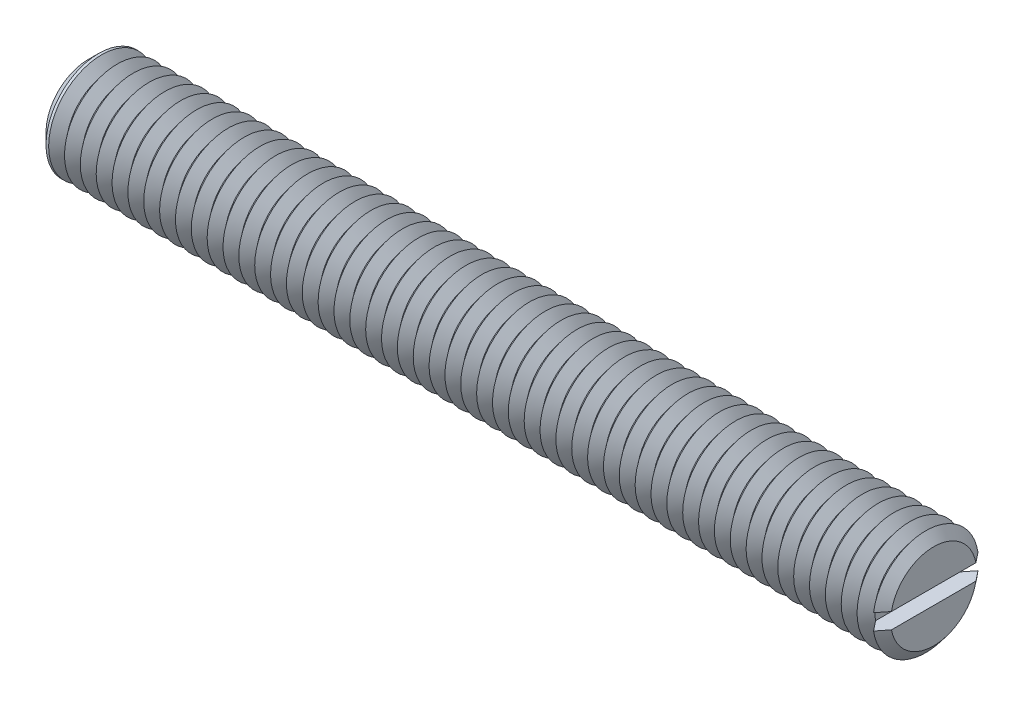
ISO-10303-21;
HEADER;
FILE_DESCRIPTION(('STEP AP214'),'2;1');
FILE_NAME('part.step','',(''),(''),'','','');
FILE_SCHEMA(('AUTOMOTIVE_DESIGN { 1 0 10303 214 1 1 1 1 }'));
ENDSEC;
DATA;
#1=APPLICATION_CONTEXT('core data for automotive mechanical design processes');
#2=APPLICATION_PROTOCOL_DEFINITION('international standard','automotive_design',2000,#1);
#3=PRODUCT_CONTEXT('',#1,'mechanical');
#4=PRODUCT('Part','Part','',(#3));
#5=PRODUCT_RELATED_PRODUCT_CATEGORY('part','',(#4));
#6=PRODUCT_DEFINITION_FORMATION('','',#4);
#7=PRODUCT_DEFINITION_CONTEXT('part definition',#1,'design');
#8=PRODUCT_DEFINITION('design','',#6,#7);
#9=PRODUCT_DEFINITION_SHAPE('','',#8);
#10=(LENGTH_UNIT() NAMED_UNIT(*) SI_UNIT(.MILLI.,.METRE.));
#11=(NAMED_UNIT(*) PLANE_ANGLE_UNIT() SI_UNIT($,.RADIAN.));
#12=(NAMED_UNIT(*) SI_UNIT($,.STERADIAN.) SOLID_ANGLE_UNIT());
#13=UNCERTAINTY_MEASURE_WITH_UNIT(LENGTH_MEASURE(1.E-05),#10,'distance_accuracy_value','');
#14=(GEOMETRIC_REPRESENTATION_CONTEXT(3) GLOBAL_UNCERTAINTY_ASSIGNED_CONTEXT((#13)) GLOBAL_UNIT_ASSIGNED_CONTEXT((#10,
#11,#12)) REPRESENTATION_CONTEXT('',''));
#15=CARTESIAN_POINT('',(0.,0.,0.));
#16=DIRECTION('',(0.,0.,1.));
#17=DIRECTION('',(1.,0.,0.));
#18=AXIS2_PLACEMENT_3D('',#15,#16,#17);
#19=CARTESIAN_POINT('',(39.25,0.,0.));
#20=DIRECTION('',(1.,0.,0.));
#21=DIRECTION('',(0.,0.,-1.));
#22=AXIS2_PLACEMENT_3D('',#19,#20,#21);
#23=CONICAL_SURFACE('',#22,5.,0.895664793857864);
#24=CARTESIAN_POINT('',(39.25,0.,0.));
#25=DIRECTION('',(-1.,0.,0.));
#26=DIRECTION('',(0.,0.,1.));
#27=AXIS2_PLACEMENT_3D('',#24,#25,#26);
#28=CIRCLE('',#27,5.);
#29=CARTESIAN_POINT('',(39.25,-0.75,-4.9434299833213));
#30=VERTEX_POINT('',#29);
#31=CARTESIAN_POINT('',(39.25,-0.75,4.9434299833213));
#32=VERTEX_POINT('',#31);
#33=EDGE_CURVE('E117',#30,#32,#28,.T.);
#34=ORIENTED_EDGE('',*,*,#33,.T.);
#35=CARTESIAN_POINT('',(43.9886555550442,-0.75,-10.8927895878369));
#36=CARTESIAN_POINT('',(43.678663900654,-0.75,-10.5046848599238));
#37=CARTESIAN_POINT('',(43.3687121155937,-0.75,-10.1165482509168));
#38=CARTESIAN_POINT('',(42.7489116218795,-0.75,-9.34012563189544));
#39=CARTESIAN_POINT('',(42.4390629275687,-0.75,-8.95183961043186));
#40=CARTESIAN_POINT('',(41.8189382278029,-0.75,-8.17433811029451));
#41=CARTESIAN_POINT('',(41.5086626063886,-0.75,-7.78512232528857));
#42=CARTESIAN_POINT('',(40.8884400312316,-0.75,-7.0064952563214));
#43=CARTESIAN_POINT('',(40.5784930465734,-0.75,-6.61708399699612));
#44=CARTESIAN_POINT('',(40.1053943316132,-0.75,-6.02191131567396));
#45=CARTESIAN_POINT('',(39.9420627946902,-0.75,-5.81629283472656));
#46=CARTESIAN_POINT('',(39.6155893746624,-0.75,-5.40490151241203));
#47=CARTESIAN_POINT('',(39.4524474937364,-0.75,-5.19912866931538));
#48=CARTESIAN_POINT('',(39.1263799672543,-0.75,-4.78730226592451));
#49=CARTESIAN_POINT('',(38.9634544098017,-0.75,-4.58124863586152));
#50=CARTESIAN_POINT('',(38.638006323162,-0.75,-4.16883695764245));
#51=CARTESIAN_POINT('',(38.4754837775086,-0.75,-3.96247892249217));
#52=CARTESIAN_POINT('',(38.1512888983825,-0.75,-3.54956515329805));
#53=CARTESIAN_POINT('',(37.9896156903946,-0.75,-3.34301010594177));
#54=CARTESIAN_POINT('',(37.6672688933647,-0.75,-2.92906737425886));
#55=CARTESIAN_POINT('',(37.5065954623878,-0.75,-2.72167956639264));
#56=CARTESIAN_POINT('',(37.2671162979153,-0.75,-2.40952296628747));
#57=CARTESIAN_POINT('',(37.187569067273,-0.75,-2.30532351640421));
#58=CARTESIAN_POINT('',(37.0292089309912,-0.75,-2.09636868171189));
#59=CARTESIAN_POINT('',(36.9503960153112,-0.75,-1.99161330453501));
#60=CARTESIAN_POINT('',(36.7939159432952,-0.75,-1.78128982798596));
#61=CARTESIAN_POINT('',(36.7162485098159,-0.75,-1.67572193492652));
#62=CARTESIAN_POINT('',(36.5627483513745,-0.75,-1.46326300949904));
#63=CARTESIAN_POINT('',(36.4869154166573,-0.75,-1.35637213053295));
#64=CARTESIAN_POINT('',(36.3961291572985,-0.75,-1.22407390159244));
#65=CARTESIAN_POINT('',(36.3795740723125,-0.75,-1.19976686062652));
#66=CARTESIAN_POINT('',(36.3466682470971,-0.75,-1.15101442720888));
#67=CARTESIAN_POINT('',(36.3303175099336,-0.75,-1.12656903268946));
#68=CARTESIAN_POINT('',(36.2816161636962,-0.75,-1.05299302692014));
#69=CARTESIAN_POINT('',(36.2496192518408,-0.75,-1.00362669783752));
#70=CARTESIAN_POINT('',(36.1868890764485,-0.75,-0.903957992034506));
#71=CARTESIAN_POINT('',(36.1561584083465,-0.75,-0.853653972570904));
#72=CARTESIAN_POINT('',(36.0966309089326,-0.75,-0.751913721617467));
#73=CARTESIAN_POINT('',(36.0678337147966,-0.75,-0.700477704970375));
#74=CARTESIAN_POINT('',(36.0225435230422,-0.75,-0.613963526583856));
#75=CARTESIAN_POINT('',(36.0052186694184,-0.75,-0.579327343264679));
#76=CARTESIAN_POINT('',(35.9722687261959,-0.75,-0.509265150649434));
#77=CARTESIAN_POINT('',(35.9566439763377,-0.75,-0.473838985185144));
#78=CARTESIAN_POINT('',(35.9132659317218,-0.75,-0.36638235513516));
#79=CARTESIAN_POINT('',(35.8888237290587,-0.75,-0.292842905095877));
#80=CARTESIAN_POINT('',(35.8658405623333,-0.75,-0.189809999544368));
#81=CARTESIAN_POINT('',(35.8606856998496,-0.75,-0.161782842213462));
#82=CARTESIAN_POINT('',(35.8527704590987,-0.75,-0.105398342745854));
#83=CARTESIAN_POINT('',(35.8500088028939,-0.75,-0.0770411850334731));
#84=CARTESIAN_POINT('',(35.8470684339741,-0.75,-0.0202548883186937));
#85=CARTESIAN_POINT('',(35.8468839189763,-0.75,0.00817394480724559));
#86=CARTESIAN_POINT('',(35.8490950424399,-0.75,0.0649322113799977));
#87=CARTESIAN_POINT('',(35.851491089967,-0.75,0.0932616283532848));
#88=CARTESIAN_POINT('',(35.8596937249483,-0.75,0.157351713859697));
#89=CARTESIAN_POINT('',(35.8662565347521,-0.75,0.193015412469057));
#90=CARTESIAN_POINT('',(35.8827020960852,-0.75,0.263573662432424));
#91=CARTESIAN_POINT('',(35.8925874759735,-0.75,0.298467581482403));
#92=CARTESIAN_POINT('',(35.9150598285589,-0.75,0.36765200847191));
#93=CARTESIAN_POINT('',(35.9276667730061,-0.75,0.401935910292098));
#94=CARTESIAN_POINT('',(35.9549130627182,-0.75,0.4696641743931));
#95=CARTESIAN_POINT('',(35.9695519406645,-0.75,0.503108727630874));
#96=CARTESIAN_POINT('',(36.0166350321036,-0.75,0.604259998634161));
#97=CARTESIAN_POINT('',(36.051542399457,-0.75,0.670810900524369));
#98=CARTESIAN_POINT('',(36.1250588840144,-0.75,0.801849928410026));
#99=CARTESIAN_POINT('',(36.1636717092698,-0.75,0.866335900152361));
#100=CARTESIAN_POINT('',(36.2432739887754,-0.75,0.994050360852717));
#101=CARTESIAN_POINT('',(36.284269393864,-0.75,1.05727512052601));
#102=CARTESIAN_POINT('',(36.3677403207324,-0.75,1.18274150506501));
#103=CARTESIAN_POINT('',(36.4102160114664,-0.75,1.24498301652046));
#104=CARTESIAN_POINT('',(36.4963066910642,-0.75,1.36895722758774));
#105=CARTESIAN_POINT('',(36.5399248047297,-0.75,1.43068775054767));
#106=CARTESIAN_POINT('',(36.6278819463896,-0.75,1.5536412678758));
#107=CARTESIAN_POINT('',(36.672221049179,-0.75,1.61486420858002));
#108=CARTESIAN_POINT('',(36.7613408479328,-0.75,1.73681254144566));
#109=CARTESIAN_POINT('',(36.8061205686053,-0.75,1.7975386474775));
#110=CARTESIAN_POINT('',(36.8960732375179,-0.75,1.91869503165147));
#111=CARTESIAN_POINT('',(36.941246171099,-0.75,1.97912532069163));
#112=CARTESIAN_POINT('',(37.0761092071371,-0.75,2.15860363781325));
#113=CARTESIAN_POINT('',(37.1662359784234,-0.75,2.27732336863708));
#114=CARTESIAN_POINT('',(37.3472315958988,-0.75,2.51419617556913));
#115=CARTESIAN_POINT('',(37.4381004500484,-0.75,2.63234924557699));
#116=CARTESIAN_POINT('',(37.7114512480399,-0.75,2.98624879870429));
#117=CARTESIAN_POINT('',(37.8946699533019,-0.75,3.22142577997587));
#118=CARTESIAN_POINT('',(38.262238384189,-0.75,3.69117947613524));
#119=CARTESIAN_POINT('',(38.4465888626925,-0.75,3.92575559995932));
#120=CARTESIAN_POINT('',(38.8158791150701,-0.75,4.39443534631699));
#121=CARTESIAN_POINT('',(39.0008188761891,-0.75,4.62853897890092));
#122=CARTESIAN_POINT('',(39.3703317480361,-0.75,5.0955158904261));
#123=CARTESIAN_POINT('',(39.5549033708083,-0.75,5.3283903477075));
#124=CARTESIAN_POINT('',(39.924299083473,-0.75,5.79394105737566));
#125=CARTESIAN_POINT('',(40.1091231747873,-0.75,6.02661730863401));
#126=CARTESIAN_POINT('',(40.6637745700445,-0.75,6.72433690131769));
#127=CARTESIAN_POINT('',(41.0338620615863,-0.75,7.18917337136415));
#128=CARTESIAN_POINT('',(41.6190458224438,-0.75,7.92356230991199));
#129=CARTESIAN_POINT('',(41.8340169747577,-0.75,8.19321453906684));
#130=CARTESIAN_POINT('',(42.2640698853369,-0.75,8.73245662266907));
#131=CARTESIAN_POINT('',(42.479151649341,-0.75,9.0020464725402));
#132=CARTESIAN_POINT('',(42.9099436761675,-0.75,9.54186292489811));
#133=CARTESIAN_POINT('',(43.1256541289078,-0.75,9.81208937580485));
#134=CARTESIAN_POINT('',(43.5571210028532,-0.75,10.3524795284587));
#135=CARTESIAN_POINT('',(43.7728774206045,-0.75,10.6226432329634));
#136=CARTESIAN_POINT('',(43.9886555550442,-0.75,10.8927895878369));
#137=B_SPLINE_CURVE_WITH_KNOTS('',3,(#35,#36,#37,#38,#39,#40,#41,#42,#43,#44,#45,#46,#47,#48,
#49,#50,#51,#52,#53,#54,#55,#56,#57,#58,#59,#60,#61,#62,#63,#64,#65,#66,#67,#68,#69,#70,#71,#72,
#73,#74,#75,#76,#77,#78,#79,#80,#81,#82,#83,#84,#85,#86,#87,#88,#89,#90,#91,#92,#93,#94,#95,#96,
#97,#98,#99,#100,#101,#102,#103,#104,#105,#106,#107,#108,#109,#110,#111,#112,#113,#114,#115,
#116,#117,#118,#119,#120,#121,#122,#123,#124,#125,#126,#127,#128,#129,#130,#131,#132,#133,#134,
#135,#136),.UNSPECIFIED.,.F.,.F.,(4,2,2,2,2,2,2,2,2,2,2,2,2,2,2,2,2,2,2,2,2,2,2,2,2,2,2,2,2,2,2,
2,2,2,2,2,2,2,2,2,2,2,2,2,2,2,2,2,2,2,4),(0.,1.49012787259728,2.98041311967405,4.47367759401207,
5.96678625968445,6.75457128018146,7.54236526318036,8.33041673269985,9.11843545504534,
9.90534542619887,10.6923767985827,11.0856530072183,11.4789238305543,11.8720978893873,
12.265226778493,12.3534535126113,12.441681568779,12.6181526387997,12.7949690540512,
12.9717521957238,13.0878863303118,13.2040436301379,13.43522465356,13.5206311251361,
13.605991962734,13.6911605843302,13.7763427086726,13.8849305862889,13.9936045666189,
14.1031049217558,14.2125801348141,14.4377857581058,14.6632191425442,14.8892420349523,
15.1152908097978,15.3420406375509,15.5688141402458,15.7951656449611,16.0215087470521,
16.4686664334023,16.91582892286,17.8101909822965,18.7052318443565,19.6002534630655,
20.491698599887,21.3831487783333,23.1656575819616,24.2002223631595,25.2348477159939,
26.2721422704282,27.3093757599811),.UNSPECIFIED.);
#138=CARTESIAN_POINT('',(38.5,-0.75,3.99343248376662));
#139=VERTEX_POINT('',#138);
#140=EDGE_CURVE('E109',#139,#32,#137,.T.);
#141=ORIENTED_EDGE('',*,*,#140,.F.);
#142=CARTESIAN_POINT('',(38.5,0.,0.));
#143=DIRECTION('',(-1.,0.,0.));
#144=DIRECTION('',(0.,0.,1.));
#145=AXIS2_PLACEMENT_3D('',#142,#143,#144);
#146=CIRCLE('',#145,4.06325030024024);
#147=CARTESIAN_POINT('',(38.5,-0.75,-3.99343248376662));
#148=VERTEX_POINT('',#147);
#149=EDGE_CURVE('E639',#148,#139,#146,.T.);
#150=ORIENTED_EDGE('',*,*,#149,.F.);
#151=EDGE_CURVE('E58',#30,#148,#137,.T.);
#152=ORIENTED_EDGE('',*,*,#151,.F.);
#153=EDGE_LOOP('',(#34,#141,#150,#152));
#154=FACE_BOUND('',#153,.T.);
#155=ADVANCED_FACE('F37',(#154),#23,.T.);
#156=CARTESIAN_POINT('',(39.25,0.75,4.9434299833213));
#157=VERTEX_POINT('',#156);
#158=CARTESIAN_POINT('',(39.25,0.75,-4.9434299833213));
#159=VERTEX_POINT('',#158);
#160=EDGE_CURVE('E100',#157,#159,#28,.T.);
#161=ORIENTED_EDGE('',*,*,#160,.T.);
#162=CARTESIAN_POINT('',(43.9886555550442,0.75,10.8927895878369));
#163=CARTESIAN_POINT('',(43.678663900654,0.75,10.5046848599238));
#164=CARTESIAN_POINT('',(43.3687121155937,0.75,10.1165482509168));
#165=CARTESIAN_POINT('',(42.7489116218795,0.75,9.34012563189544));
#166=CARTESIAN_POINT('',(42.4390629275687,0.75,8.95183961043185));
#167=CARTESIAN_POINT('',(41.8189382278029,0.75,8.1743381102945));
#168=CARTESIAN_POINT('',(41.5086626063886,0.75,7.78512232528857));
#169=CARTESIAN_POINT('',(40.8884400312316,0.75,7.0064952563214));
#170=CARTESIAN_POINT('',(40.5784930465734,0.75,6.61708399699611));
#171=CARTESIAN_POINT('',(40.1053943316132,0.75,6.02191131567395));
#172=CARTESIAN_POINT('',(39.9420627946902,0.75,5.81629283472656));
#173=CARTESIAN_POINT('',(39.6155893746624,0.75,5.40490151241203));
#174=CARTESIAN_POINT('',(39.4524474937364,0.75,5.19912866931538));
#175=CARTESIAN_POINT('',(39.1263799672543,0.75,4.78730226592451));
#176=CARTESIAN_POINT('',(38.9634544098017,0.75,4.58124863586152));
#177=CARTESIAN_POINT('',(38.638006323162,0.75,4.16883695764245));
#178=CARTESIAN_POINT('',(38.4754837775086,0.75,3.96247892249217));
#179=CARTESIAN_POINT('',(38.1512888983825,0.75,3.54956515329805));
#180=CARTESIAN_POINT('',(37.9896156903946,0.75,3.34301010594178));
#181=CARTESIAN_POINT('',(37.6672688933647,0.75,2.92906737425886));
#182=CARTESIAN_POINT('',(37.5065954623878,0.75,2.72167956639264));
#183=CARTESIAN_POINT('',(37.2671162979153,0.75,2.40952296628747));
#184=CARTESIAN_POINT('',(37.187569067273,0.75,2.30532351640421));
#185=CARTESIAN_POINT('',(37.0292089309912,0.75,2.09636868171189));
#186=CARTESIAN_POINT('',(36.9503960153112,0.75,1.99161330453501));
#187=CARTESIAN_POINT('',(36.7939159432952,0.75,1.78128982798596));
#188=CARTESIAN_POINT('',(36.7162485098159,0.75,1.67572193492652));
#189=CARTESIAN_POINT('',(36.5627483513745,0.75,1.46326300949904));
#190=CARTESIAN_POINT('',(36.4869154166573,0.75,1.35637213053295));
#191=CARTESIAN_POINT('',(36.3961291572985,0.75,1.22407390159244));
#192=CARTESIAN_POINT('',(36.3795740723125,0.75,1.19976686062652));
#193=CARTESIAN_POINT('',(36.3466682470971,0.75,1.15101442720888));
#194=CARTESIAN_POINT('',(36.3303175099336,0.75,1.12656903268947));
#195=CARTESIAN_POINT('',(36.2816161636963,0.75,1.05299302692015));
#196=CARTESIAN_POINT('',(36.2496192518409,0.75,1.00362669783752));
#197=CARTESIAN_POINT('',(36.1868890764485,0.75,0.903957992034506));
#198=CARTESIAN_POINT('',(36.1561584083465,0.75,0.853653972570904));
#199=CARTESIAN_POINT('',(36.0966309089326,0.75,0.751913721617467));
#200=CARTESIAN_POINT('',(36.0678337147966,0.75,0.700477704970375));
#201=CARTESIAN_POINT('',(36.0225435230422,0.75,0.613963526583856));
#202=CARTESIAN_POINT('',(36.0052186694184,0.75,0.579327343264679));
#203=CARTESIAN_POINT('',(35.9722687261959,0.75,0.509265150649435));
#204=CARTESIAN_POINT('',(35.9566439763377,0.75,0.473838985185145));
#205=CARTESIAN_POINT('',(35.9132659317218,0.75,0.366382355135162));
#206=CARTESIAN_POINT('',(35.8888237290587,0.75,0.292842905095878));
#207=CARTESIAN_POINT('',(35.8658405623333,0.75,0.189809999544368));
#208=CARTESIAN_POINT('',(35.8606856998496,0.75,0.161782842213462));
#209=CARTESIAN_POINT('',(35.8527704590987,0.75,0.105398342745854));
#210=CARTESIAN_POINT('',(35.8500088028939,0.75,0.077041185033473));
#211=CARTESIAN_POINT('',(35.8470684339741,0.75,0.0202548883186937));
#212=CARTESIAN_POINT('',(35.8468839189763,0.75,-0.00817394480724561));
#213=CARTESIAN_POINT('',(35.8490950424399,0.75,-0.0649322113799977));
#214=CARTESIAN_POINT('',(35.851491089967,0.75,-0.0932616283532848));
#215=CARTESIAN_POINT('',(35.8596937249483,0.75,-0.157351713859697));
#216=CARTESIAN_POINT('',(35.8662565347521,0.75,-0.193015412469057));
#217=CARTESIAN_POINT('',(35.8827020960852,0.75,-0.263573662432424));
#218=CARTESIAN_POINT('',(35.8925874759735,0.75,-0.298467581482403));
#219=CARTESIAN_POINT('',(35.9150598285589,0.75,-0.36765200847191));
#220=CARTESIAN_POINT('',(35.9276667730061,0.75,-0.401935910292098));
#221=CARTESIAN_POINT('',(35.9549130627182,0.75,-0.4696641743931));
#222=CARTESIAN_POINT('',(35.9695519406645,0.75,-0.503108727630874));
#223=CARTESIAN_POINT('',(36.0166350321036,0.75,-0.604259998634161));
#224=CARTESIAN_POINT('',(36.051542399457,0.75,-0.670810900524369));
#225=CARTESIAN_POINT('',(36.1250588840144,0.75,-0.801849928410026));
#226=CARTESIAN_POINT('',(36.1636717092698,0.75,-0.866335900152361));
#227=CARTESIAN_POINT('',(36.2432739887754,0.75,-0.994050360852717));
#228=CARTESIAN_POINT('',(36.284269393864,0.75,-1.05727512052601));
#229=CARTESIAN_POINT('',(36.3677403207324,0.75,-1.18274150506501));
#230=CARTESIAN_POINT('',(36.4102160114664,0.75,-1.24498301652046));
#231=CARTESIAN_POINT('',(36.4963066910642,0.75,-1.36895722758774));
#232=CARTESIAN_POINT('',(36.5399248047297,0.75,-1.43068775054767));
#233=CARTESIAN_POINT('',(36.6278819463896,0.75,-1.5536412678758));
#234=CARTESIAN_POINT('',(36.672221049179,0.75,-1.61486420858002));
#235=CARTESIAN_POINT('',(36.7613408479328,0.75,-1.73681254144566));
#236=CARTESIAN_POINT('',(36.8061205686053,0.75,-1.79753864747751));
#237=CARTESIAN_POINT('',(36.8960732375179,0.75,-1.91869503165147));
#238=CARTESIAN_POINT('',(36.941246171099,0.75,-1.97912532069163));
#239=CARTESIAN_POINT('',(37.0761092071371,0.75,-2.15860363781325));
#240=CARTESIAN_POINT('',(37.1662359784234,0.75,-2.27732336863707));
#241=CARTESIAN_POINT('',(37.3472315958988,0.75,-2.51419617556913));
#242=CARTESIAN_POINT('',(37.4381004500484,0.75,-2.63234924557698));
#243=CARTESIAN_POINT('',(37.7114512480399,0.75,-2.98624879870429));
#244=CARTESIAN_POINT('',(37.8946699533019,0.75,-3.22142577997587));
#245=CARTESIAN_POINT('',(38.262238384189,0.75,-3.69117947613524));
#246=CARTESIAN_POINT('',(38.4465888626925,0.75,-3.92575559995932));
#247=CARTESIAN_POINT('',(38.8158791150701,0.75,-4.39443534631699));
#248=CARTESIAN_POINT('',(39.0008188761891,0.75,-4.62853897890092));
#249=CARTESIAN_POINT('',(39.3703317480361,0.75,-5.0955158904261));
#250=CARTESIAN_POINT('',(39.5549033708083,0.75,-5.3283903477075));
#251=CARTESIAN_POINT('',(39.924299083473,0.75,-5.79394105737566));
#252=CARTESIAN_POINT('',(40.1091231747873,0.75,-6.02661730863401));
#253=CARTESIAN_POINT('',(40.6637745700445,0.75,-6.72433690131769));
#254=CARTESIAN_POINT('',(41.0338620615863,0.75,-7.18917337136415));
#255=CARTESIAN_POINT('',(41.6190458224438,0.75,-7.92356230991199));
#256=CARTESIAN_POINT('',(41.8340169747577,0.75,-8.19321453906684));
#257=CARTESIAN_POINT('',(42.2640698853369,0.75,-8.73245662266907));
#258=CARTESIAN_POINT('',(42.479151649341,0.75,-9.0020464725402));
#259=CARTESIAN_POINT('',(42.9099436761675,0.75,-9.5418629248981));
#260=CARTESIAN_POINT('',(43.1256541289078,0.75,-9.81208937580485));
#261=CARTESIAN_POINT('',(43.5571210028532,0.75,-10.3524795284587));
#262=CARTESIAN_POINT('',(43.7728774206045,0.75,-10.6226432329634));
#263=CARTESIAN_POINT('',(43.9886555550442,0.75,-10.8927895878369));
#264=B_SPLINE_CURVE_WITH_KNOTS('',3,(#162,#163,#164,#165,#166,#167,#168,#169,#170,#171,#172,
#173,#174,#175,#176,#177,#178,#179,#180,#181,#182,#183,#184,#185,#186,#187,#188,#189,#190,#191,
#192,#193,#194,#195,#196,#197,#198,#199,#200,#201,#202,#203,#204,#205,#206,#207,#208,#209,#210,
#211,#212,#213,#214,#215,#216,#217,#218,#219,#220,#221,#222,#223,#224,#225,#226,#227,#228,#229,
#230,#231,#232,#233,#234,#235,#236,#237,#238,#239,#240,#241,#242,#243,#244,#245,#246,#247,#248,
#249,#250,#251,#252,#253,#254,#255,#256,#257,#258,#259,#260,#261,#262,#263),.UNSPECIFIED.,.F.,
.F.,(4,2,2,2,2,2,2,2,2,2,2,2,2,2,2,2,2,2,2,2,2,2,2,2,2,2,2,2,2,2,2,2,2,2,2,2,2,2,2,2,2,2,2,2,2,
2,2,2,2,2,4),(0.,1.49012787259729,2.98041311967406,4.47367759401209,5.96678625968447,
6.75457128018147,7.54236526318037,8.33041673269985,9.11843545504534,9.90534542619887,
10.6923767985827,11.0856530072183,11.4789238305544,11.8720978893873,12.265226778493,
12.3534535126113,12.441681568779,12.6181526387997,12.7949690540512,12.9717521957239,
13.0878863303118,13.2040436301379,13.43522465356,13.5206311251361,13.6059919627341,
13.6911605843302,13.7763427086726,13.8849305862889,13.9936045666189,14.1031049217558,
14.2125801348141,14.4377857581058,14.6632191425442,14.8892420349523,15.1152908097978,
15.3420406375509,15.5688141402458,15.7951656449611,16.0215087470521,16.4686664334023,
16.91582892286,17.8101909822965,18.7052318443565,19.6002534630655,20.491698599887,
21.3831487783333,23.1656575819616,24.2002223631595,25.2348477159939,26.2721422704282,
27.3093757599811),.UNSPECIFIED.);
#265=CARTESIAN_POINT('',(38.5,0.75,-3.99343248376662));
#266=VERTEX_POINT('',#265);
#267=EDGE_CURVE('E110',#266,#159,#264,.T.);
#268=ORIENTED_EDGE('',*,*,#267,.F.);
#269=CARTESIAN_POINT('',(38.5,0.75,3.99343248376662));
#270=VERTEX_POINT('',#269);
#271=EDGE_CURVE('E103',#270,#266,#146,.T.);
#272=ORIENTED_EDGE('',*,*,#271,.F.);
#273=EDGE_CURVE('E97',#157,#270,#264,.T.);
#274=ORIENTED_EDGE('',*,*,#273,.F.);
#275=EDGE_LOOP('',(#161,#268,#272,#274));
#276=FACE_BOUND('',#275,.T.);
#277=ADVANCED_FACE('F99',(#276),#23,.T.);
#278=CARTESIAN_POINT('',(38.5,0.,0.));
#279=DIRECTION('',(-1.,0.,0.));
#280=DIRECTION('',(0.,0.,1.));
#281=AXIS2_PLACEMENT_3D('',#278,#279,#280);
#282=CONICAL_SURFACE('',#281,4.06325030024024,0.895664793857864);
#283=CARTESIAN_POINT('',(37.75,0.,0.));
#284=DIRECTION('',(-1.,0.,0.));
#285=DIRECTION('',(0.,0.,1.));
#286=AXIS2_PLACEMENT_3D('',#283,#284,#285);
#287=CIRCLE('',#286,5.);
#288=CARTESIAN_POINT('',(37.75,0.,5.));
#289=VERTEX_POINT('',#288);
#290=EDGE_CURVE('E625',#289,#289,#287,.T.);
#291=ORIENTED_EDGE('',*,*,#290,.F.);
#292=EDGE_LOOP('',(#291));
#293=FACE_BOUND('',#292,.T.);
#294=ORIENTED_EDGE('',*,*,#271,.T.);
#295=EDGE_CURVE('E633',#266,#148,#146,.T.);
#296=ORIENTED_EDGE('',*,*,#295,.T.);
#297=ORIENTED_EDGE('',*,*,#149,.T.);
#298=EDGE_CURVE('E631',#139,#270,#146,.T.);
#299=ORIENTED_EDGE('',*,*,#298,.T.);
#300=EDGE_LOOP('',(#294,#296,#297,#299));
#301=FACE_BOUND('',#300,.T.);
#302=ADVANCED_FACE('F166',(#293,#301),#282,.T.);
#303=CARTESIAN_POINT('',(40.,0.,0.));
#304=DIRECTION('',(1.,0.,0.));
#305=DIRECTION('',(0.,0.,-1.));
#306=AXIS2_PLACEMENT_3D('',#303,#304,#305);
#307=PLANE('',#306);
#308=CARTESIAN_POINT('',(40.,0.,0.));
#309=DIRECTION('',(-1.,0.,0.));
#310=DIRECTION('',(0.,0.,1.));
#311=AXIS2_PLACEMENT_3D('',#308,#309,#310);
#312=CIRCLE('',#311,4.06325030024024);
#313=CARTESIAN_POINT('',(40.,0.75,3.99343248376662));
#314=VERTEX_POINT('',#313);
#315=CARTESIAN_POINT('',(40.,0.75,-3.99343248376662));
#316=VERTEX_POINT('',#315);
#317=EDGE_CURVE('E158',#314,#316,#312,.T.);
#318=ORIENTED_EDGE('',*,*,#317,.F.);
#319=DIRECTION('',(0.,0.,1.));
#320=VECTOR('',#319,1.);
#321=CARTESIAN_POINT('',(40.,0.75,0.));
#322=LINE('',#321,#320);
#323=EDGE_CURVE('E122',#316,#314,#322,.T.);
#324=ORIENTED_EDGE('',*,*,#323,.F.);
#325=EDGE_LOOP('',(#318,#324));
#326=FACE_BOUND('',#325,.T.);
#327=ADVANCED_FACE('F170',(#326),#307,.T.);
#328=CARTESIAN_POINT('',(40.,-0.75,-3.99343248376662));
#329=VERTEX_POINT('',#328);
#330=CARTESIAN_POINT('',(40.,-0.75,3.99343248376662));
#331=VERTEX_POINT('',#330);
#332=EDGE_CURVE('E66',#329,#331,#312,.T.);
#333=ORIENTED_EDGE('',*,*,#332,.F.);
#334=DIRECTION('',(0.,0.,-1.));
#335=VECTOR('',#334,1.);
#336=CARTESIAN_POINT('',(40.,-0.75,0.));
#337=LINE('',#336,#335);
#338=EDGE_CURVE('E134',#331,#329,#337,.T.);
#339=ORIENTED_EDGE('',*,*,#338,.F.);
#340=EDGE_LOOP('',(#333,#339));
#341=FACE_BOUND('',#340,.T.);
#342=ADVANCED_FACE('F199',(#341),#307,.T.);
#343=CARTESIAN_POINT('',(40.,0.,0.));
#344=DIRECTION('',(-1.,0.,0.));
#345=DIRECTION('',(0.,0.,1.));
#346=AXIS2_PLACEMENT_3D('',#343,#344,#345);
#347=CONICAL_SURFACE('',#346,4.06325030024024,0.895664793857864);
#348=ORIENTED_EDGE('',*,*,#160,.F.);
#349=CARTESIAN_POINT('',(34.5113444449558,0.75,-10.8927895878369));
#350=CARTESIAN_POINT('',(34.821336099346,0.75,-10.5046848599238));
#351=CARTESIAN_POINT('',(35.1312878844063,0.75,-10.1165482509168));
#352=CARTESIAN_POINT('',(35.7510883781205,0.75,-9.34012563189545));
#353=CARTESIAN_POINT('',(36.0609370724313,0.75,-8.95183961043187));
#354=CARTESIAN_POINT('',(36.6810617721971,0.75,-8.17433811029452));
#355=CARTESIAN_POINT('',(36.9913373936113,0.75,-7.78512232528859));
#356=CARTESIAN_POINT('',(37.6115599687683,0.75,-7.00649525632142));
#357=CARTESIAN_POINT('',(37.9215069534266,0.75,-6.61708399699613));
#358=CARTESIAN_POINT('',(38.3946056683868,0.75,-6.02191131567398));
#359=CARTESIAN_POINT('',(38.5579372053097,0.75,-5.81629283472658));
#360=CARTESIAN_POINT('',(38.8844106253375,0.75,-5.40490151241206));
#361=CARTESIAN_POINT('',(39.0475525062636,0.75,-5.1991286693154));
#362=CARTESIAN_POINT('',(39.3736200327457,0.75,-4.78730226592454));
#363=CARTESIAN_POINT('',(39.5365455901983,0.75,-4.58124863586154));
#364=CARTESIAN_POINT('',(39.861993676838,0.75,-4.16883695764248));
#365=CARTESIAN_POINT('',(40.0245162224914,0.75,-3.96247892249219));
#366=CARTESIAN_POINT('',(40.3487111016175,0.75,-3.54956515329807));
#367=CARTESIAN_POINT('',(40.5103843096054,0.75,-3.34301010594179));
#368=CARTESIAN_POINT('',(40.8327311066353,0.75,-2.92906737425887));
#369=CARTESIAN_POINT('',(40.9934045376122,0.75,-2.72167956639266));
#370=CARTESIAN_POINT('',(41.2328837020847,0.75,-2.40952296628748));
#371=CARTESIAN_POINT('',(41.312430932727,0.75,-2.30532351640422));
#372=CARTESIAN_POINT('',(41.4707910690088,0.75,-2.09636868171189));
#373=CARTESIAN_POINT('',(41.5496039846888,0.75,-1.99161330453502));
#374=CARTESIAN_POINT('',(41.7060840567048,0.75,-1.78128982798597));
#375=CARTESIAN_POINT('',(41.7837514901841,0.75,-1.67572193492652));
#376=CARTESIAN_POINT('',(41.9372516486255,0.75,-1.46326300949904));
#377=CARTESIAN_POINT('',(42.0130845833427,0.75,-1.35637213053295));
#378=CARTESIAN_POINT('',(42.1038708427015,0.75,-1.22407390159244));
#379=CARTESIAN_POINT('',(42.1204259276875,0.75,-1.19976686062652));
#380=CARTESIAN_POINT('',(42.1533317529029,0.75,-1.15101442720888));
#381=CARTESIAN_POINT('',(42.1696824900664,0.75,-1.12656903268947));
#382=CARTESIAN_POINT('',(42.2183838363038,0.75,-1.05299302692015));
#383=CARTESIAN_POINT('',(42.2503807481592,0.75,-1.00362669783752));
#384=CARTESIAN_POINT('',(42.3131109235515,0.75,-0.903957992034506));
#385=CARTESIAN_POINT('',(42.3438415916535,0.75,-0.853653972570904));
#386=CARTESIAN_POINT('',(42.4033690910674,0.75,-0.751913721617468));
#387=CARTESIAN_POINT('',(42.4321662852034,0.75,-0.700477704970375));
#388=CARTESIAN_POINT('',(42.4774564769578,0.75,-0.613963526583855));
#389=CARTESIAN_POINT('',(42.4947813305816,0.75,-0.579327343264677));
#390=CARTESIAN_POINT('',(42.5277312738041,0.75,-0.509265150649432));
#391=CARTESIAN_POINT('',(42.5433560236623,0.75,-0.473838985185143));
#392=CARTESIAN_POINT('',(42.5867340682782,0.75,-0.36638235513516));
#393=CARTESIAN_POINT('',(42.6111762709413,0.75,-0.292842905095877));
#394=CARTESIAN_POINT('',(42.6341594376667,0.75,-0.189809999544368));
#395=CARTESIAN_POINT('',(42.6393143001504,0.75,-0.161782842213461));
#396=CARTESIAN_POINT('',(42.6472295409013,0.75,-0.105398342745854));
#397=CARTESIAN_POINT('',(42.6499911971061,0.75,-0.0770411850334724));
#398=CARTESIAN_POINT('',(42.6529315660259,0.75,-0.0202548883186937));
#399=CARTESIAN_POINT('',(42.6531160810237,0.75,0.00817394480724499));
#400=CARTESIAN_POINT('',(42.6509049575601,0.75,0.0649322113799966));
#401=CARTESIAN_POINT('',(42.648508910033,0.75,0.0932616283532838));
#402=CARTESIAN_POINT('',(42.6403062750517,0.75,0.157351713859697));
#403=CARTESIAN_POINT('',(42.6337434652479,0.75,0.193015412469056));
#404=CARTESIAN_POINT('',(42.6172979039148,0.75,0.263573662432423));
#405=CARTESIAN_POINT('',(42.6074125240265,0.75,0.298467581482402));
#406=CARTESIAN_POINT('',(42.5849401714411,0.75,0.367652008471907));
#407=CARTESIAN_POINT('',(42.5723332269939,0.75,0.401935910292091));
#408=CARTESIAN_POINT('',(42.5450869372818,0.75,0.469664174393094));
#409=CARTESIAN_POINT('',(42.5304480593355,0.75,0.50310872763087));
#410=CARTESIAN_POINT('',(42.4833649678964,0.75,0.604259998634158));
#411=CARTESIAN_POINT('',(42.448457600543,0.75,0.670810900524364));
#412=CARTESIAN_POINT('',(42.3749411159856,0.75,0.80184992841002));
#413=CARTESIAN_POINT('',(42.3363282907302,0.75,0.866335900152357));
#414=CARTESIAN_POINT('',(42.2567260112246,0.75,0.994050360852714));
#415=CARTESIAN_POINT('',(42.215730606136,0.75,1.05727512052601));
#416=CARTESIAN_POINT('',(42.1322596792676,0.75,1.182741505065));
#417=CARTESIAN_POINT('',(42.0897839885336,0.75,1.24498301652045));
#418=CARTESIAN_POINT('',(42.0036933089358,0.75,1.36895722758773));
#419=CARTESIAN_POINT('',(41.9600751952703,0.75,1.43068775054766));
#420=CARTESIAN_POINT('',(41.8721180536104,0.75,1.5536412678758));
#421=CARTESIAN_POINT('',(41.827778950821,0.75,1.61486420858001));
#422=CARTESIAN_POINT('',(41.7386591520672,0.75,1.73681254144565));
#423=CARTESIAN_POINT('',(41.6938794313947,0.75,1.7975386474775));
#424=CARTESIAN_POINT('',(41.6039267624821,0.75,1.91869503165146));
#425=CARTESIAN_POINT('',(41.558753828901,0.75,1.97912532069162));
#426=CARTESIAN_POINT('',(41.4238907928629,0.75,2.15860363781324));
#427=CARTESIAN_POINT('',(41.3337640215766,0.75,2.27732336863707));
#428=CARTESIAN_POINT('',(41.1527684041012,0.75,2.51419617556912));
#429=CARTESIAN_POINT('',(41.0618995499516,0.75,2.63234924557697));
#430=CARTESIAN_POINT('',(40.7885487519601,0.75,2.98624879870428));
#431=CARTESIAN_POINT('',(40.6053300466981,0.75,3.22142577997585));
#432=CARTESIAN_POINT('',(40.237761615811,0.75,3.69117947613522));
#433=CARTESIAN_POINT('',(40.0534111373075,0.75,3.92575559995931));
#434=CARTESIAN_POINT('',(39.6841208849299,0.75,4.39443534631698));
#435=CARTESIAN_POINT('',(39.4991811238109,0.75,4.62853897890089));
#436=CARTESIAN_POINT('',(39.129668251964,0.75,5.09551589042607));
#437=CARTESIAN_POINT('',(38.9450966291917,0.75,5.32839034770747));
#438=CARTESIAN_POINT('',(38.575700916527,0.75,5.79394105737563));
#439=CARTESIAN_POINT('',(38.3908768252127,0.75,6.02661730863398));
#440=CARTESIAN_POINT('',(37.8362254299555,0.75,6.72433690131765));
#441=CARTESIAN_POINT('',(37.4661379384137,0.75,7.18917337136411));
#442=CARTESIAN_POINT('',(36.8809541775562,0.75,7.92356230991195));
#443=CARTESIAN_POINT('',(36.6659830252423,0.75,8.19321453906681));
#444=CARTESIAN_POINT('',(36.2359301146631,0.75,8.73245662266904));
#445=CARTESIAN_POINT('',(36.020848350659,0.75,9.00204647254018));
#446=CARTESIAN_POINT('',(35.5900563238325,0.75,9.54186292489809));
#447=CARTESIAN_POINT('',(35.3743458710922,0.75,9.81208937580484));
#448=CARTESIAN_POINT('',(34.9428789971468,0.75,10.3524795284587));
#449=CARTESIAN_POINT('',(34.7271225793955,0.75,10.6226432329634));
#450=CARTESIAN_POINT('',(34.5113444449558,0.75,10.8927895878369));
#451=B_SPLINE_CURVE_WITH_KNOTS('',3,(#349,#350,#351,#352,#353,#354,#355,#356,#357,#358,#359,
#360,#361,#362,#363,#364,#365,#366,#367,#368,#369,#370,#371,#372,#373,#374,#375,#376,#377,#378,
#379,#380,#381,#382,#383,#384,#385,#386,#387,#388,#389,#390,#391,#392,#393,#394,#395,#396,#397,
#398,#399,#400,#401,#402,#403,#404,#405,#406,#407,#408,#409,#410,#411,#412,#413,#414,#415,#416,
#417,#418,#419,#420,#421,#422,#423,#424,#425,#426,#427,#428,#429,#430,#431,#432,#433,#434,#435,
#436,#437,#438,#439,#440,#441,#442,#443,#444,#445,#446,#447,#448,#449,#450),.UNSPECIFIED.,.F.,
.F.,(4,2,2,2,2,2,2,2,2,2,2,2,2,2,2,2,2,2,2,2,2,2,2,2,2,2,2,2,2,2,2,2,2,2,2,2,2,2,2,2,2,2,2,2,2,
2,2,2,2,2,4),(0.,1.49012787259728,2.98041311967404,4.47367759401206,5.96678625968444,
6.75457128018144,7.54236526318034,8.33041673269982,9.11843545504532,9.90534542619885,
10.6923767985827,11.0856530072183,11.4789238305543,11.8720978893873,12.265226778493,
12.3534535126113,12.441681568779,12.6181526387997,12.7949690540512,12.9717521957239,
13.0878863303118,13.2040436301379,13.43522465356,13.5206311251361,13.6059919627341,
13.6911605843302,13.7763427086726,13.8849305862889,13.993604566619,14.1031049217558,
14.2125801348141,14.4377857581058,14.6632191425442,14.8892420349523,15.1152908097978,
15.3420406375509,15.5688141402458,15.7951656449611,16.0215087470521,16.4686664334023,
16.91582892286,17.8101909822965,18.7052318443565,19.6002534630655,20.491698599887,
21.3831487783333,23.1656575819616,24.2002223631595,25.2348477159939,26.2721422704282,
27.3093757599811),.UNSPECIFIED.);
#452=EDGE_CURVE('E41',#314,#157,#451,.T.);
#453=ORIENTED_EDGE('',*,*,#452,.F.);
#454=ORIENTED_EDGE('',*,*,#317,.T.);
#455=EDGE_CURVE('E11',#159,#316,#451,.T.);
#456=ORIENTED_EDGE('',*,*,#455,.F.);
#457=EDGE_LOOP('',(#348,#453,#454,#456));
#458=FACE_BOUND('',#457,.T.);
#459=ADVANCED_FACE('F114',(#458),#347,.T.);
#460=CARTESIAN_POINT('',(40.,0.75,-7.5));
#461=DIRECTION('',(0.,1.,0.));
#462=DIRECTION('',(0.,0.,1.));
#463=AXIS2_PLACEMENT_3D('',#460,#461,#462);
#464=PLANE('',#463);
#465=ORIENTED_EDGE('',*,*,#452,.T.);
#466=ORIENTED_EDGE('',*,*,#273,.T.);
#467=DIRECTION('',(0.,0.,1.));
#468=VECTOR('',#467,1.);
#469=CARTESIAN_POINT('',(38.5,0.75,-7.5));
#470=LINE('',#469,#468);
#471=EDGE_CURVE('E143',#266,#270,#470,.T.);
#472=ORIENTED_EDGE('',*,*,#471,.F.);
#473=ORIENTED_EDGE('',*,*,#267,.T.);
#474=ORIENTED_EDGE('',*,*,#455,.T.);
#475=ORIENTED_EDGE('',*,*,#323,.T.);
#476=EDGE_LOOP('',(#465,#466,#472,#473,#474,#475));
#477=FACE_BOUND('',#476,.T.);
#478=ADVANCED_FACE('F120',(#477),#464,.F.);
#479=ORIENTED_EDGE('',*,*,#33,.F.);
#480=CARTESIAN_POINT('',(34.5113444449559,-0.75,10.8927895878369));
#481=CARTESIAN_POINT('',(34.821336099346,-0.75,10.5046848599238));
#482=CARTESIAN_POINT('',(35.1312878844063,-0.75,10.1165482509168));
#483=CARTESIAN_POINT('',(35.7510883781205,-0.75,9.34012563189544));
#484=CARTESIAN_POINT('',(36.0609370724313,-0.75,8.95183961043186));
#485=CARTESIAN_POINT('',(36.6810617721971,-0.75,8.17433811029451));
#486=CARTESIAN_POINT('',(36.9913373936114,-0.75,7.78512232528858));
#487=CARTESIAN_POINT('',(37.6115599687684,-0.75,7.00649525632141));
#488=CARTESIAN_POINT('',(37.9215069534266,-0.75,6.61708399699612));
#489=CARTESIAN_POINT('',(38.3946056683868,-0.75,6.02191131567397));
#490=CARTESIAN_POINT('',(38.5579372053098,-0.75,5.81629283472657));
#491=CARTESIAN_POINT('',(38.8844106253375,-0.75,5.40490151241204));
#492=CARTESIAN_POINT('',(39.0475525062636,-0.75,5.19912866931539));
#493=CARTESIAN_POINT('',(39.3736200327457,-0.75,4.78730226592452));
#494=CARTESIAN_POINT('',(39.5365455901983,-0.75,4.58124863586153));
#495=CARTESIAN_POINT('',(39.861993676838,-0.75,4.16883695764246));
#496=CARTESIAN_POINT('',(40.0245162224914,-0.75,3.96247892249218));
#497=CARTESIAN_POINT('',(40.3487111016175,-0.75,3.54956515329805));
#498=CARTESIAN_POINT('',(40.5103843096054,-0.75,3.34301010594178));
#499=CARTESIAN_POINT('',(40.8327311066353,-0.75,2.92906737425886));
#500=CARTESIAN_POINT('',(40.9934045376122,-0.75,2.72167956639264));
#501=CARTESIAN_POINT('',(41.2328837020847,-0.75,2.40952296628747));
#502=CARTESIAN_POINT('',(41.312430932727,-0.75,2.30532351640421));
#503=CARTESIAN_POINT('',(41.4707910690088,-0.75,2.09636868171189));
#504=CARTESIAN_POINT('',(41.5496039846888,-0.75,1.99161330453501));
#505=CARTESIAN_POINT('',(41.7060840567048,-0.75,1.78128982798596));
#506=CARTESIAN_POINT('',(41.7837514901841,-0.75,1.67572193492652));
#507=CARTESIAN_POINT('',(41.9372516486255,-0.75,1.46326300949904));
#508=CARTESIAN_POINT('',(42.0130845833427,-0.75,1.35637213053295));
#509=CARTESIAN_POINT('',(42.1038708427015,-0.75,1.22407390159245));
#510=CARTESIAN_POINT('',(42.1204259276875,-0.75,1.19976686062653));
#511=CARTESIAN_POINT('',(42.1533317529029,-0.75,1.15101442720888));
#512=CARTESIAN_POINT('',(42.1696824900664,-0.75,1.12656903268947));
#513=CARTESIAN_POINT('',(42.2183838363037,-0.75,1.05299302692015));
#514=CARTESIAN_POINT('',(42.2503807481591,-0.75,1.00362669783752));
#515=CARTESIAN_POINT('',(42.3131109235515,-0.75,0.903957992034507));
#516=CARTESIAN_POINT('',(42.3438415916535,-0.75,0.853653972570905));
#517=CARTESIAN_POINT('',(42.4033690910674,-0.75,0.751913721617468));
#518=CARTESIAN_POINT('',(42.4321662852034,-0.75,0.700477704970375));
#519=CARTESIAN_POINT('',(42.4774564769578,-0.75,0.613963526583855));
#520=CARTESIAN_POINT('',(42.4947813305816,-0.75,0.579327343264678));
#521=CARTESIAN_POINT('',(42.5277312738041,-0.75,0.509265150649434));
#522=CARTESIAN_POINT('',(42.5433560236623,-0.75,0.473838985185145));
#523=CARTESIAN_POINT('',(42.5867340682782,-0.75,0.366382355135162));
#524=CARTESIAN_POINT('',(42.6111762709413,-0.75,0.292842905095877));
#525=CARTESIAN_POINT('',(42.6341594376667,-0.75,0.189809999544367));
#526=CARTESIAN_POINT('',(42.6393143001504,-0.75,0.161782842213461));
#527=CARTESIAN_POINT('',(42.6472295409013,-0.75,0.105398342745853));
#528=CARTESIAN_POINT('',(42.6499911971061,-0.75,0.0770411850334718));
#529=CARTESIAN_POINT('',(42.6529315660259,-0.75,0.0202548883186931));
#530=CARTESIAN_POINT('',(42.6531160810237,-0.75,-0.00817394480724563));
#531=CARTESIAN_POINT('',(42.6509049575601,-0.75,-0.0649322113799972));
#532=CARTESIAN_POINT('',(42.648508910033,-0.75,-0.0932616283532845));
#533=CARTESIAN_POINT('',(42.6403062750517,-0.75,-0.157351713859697));
#534=CARTESIAN_POINT('',(42.6337434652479,-0.75,-0.193015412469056));
#535=CARTESIAN_POINT('',(42.6172979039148,-0.75,-0.263573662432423));
#536=CARTESIAN_POINT('',(42.6074125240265,-0.75,-0.298467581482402));
#537=CARTESIAN_POINT('',(42.5849401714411,-0.75,-0.367652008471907));
#538=CARTESIAN_POINT('',(42.5723332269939,-0.75,-0.401935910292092));
#539=CARTESIAN_POINT('',(42.5450869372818,-0.75,-0.469664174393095));
#540=CARTESIAN_POINT('',(42.5304480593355,-0.75,-0.503108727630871));
#541=CARTESIAN_POINT('',(42.4833649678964,-0.75,-0.604259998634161));
#542=CARTESIAN_POINT('',(42.448457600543,-0.75,-0.670810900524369));
#543=CARTESIAN_POINT('',(42.3749411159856,-0.75,-0.801849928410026));
#544=CARTESIAN_POINT('',(42.3363282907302,-0.75,-0.866335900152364));
#545=CARTESIAN_POINT('',(42.2567260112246,-0.75,-0.994050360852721));
#546=CARTESIAN_POINT('',(42.215730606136,-0.75,-1.05727512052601));
#547=CARTESIAN_POINT('',(42.1322596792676,-0.75,-1.18274150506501));
#548=CARTESIAN_POINT('',(42.0897839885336,-0.75,-1.24498301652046));
#549=CARTESIAN_POINT('',(42.0036933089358,-0.75,-1.36895722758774));
#550=CARTESIAN_POINT('',(41.9600751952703,-0.75,-1.43068775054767));
#551=CARTESIAN_POINT('',(41.8721180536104,-0.75,-1.55364126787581));
#552=CARTESIAN_POINT('',(41.827778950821,-0.75,-1.61486420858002));
#553=CARTESIAN_POINT('',(41.7386591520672,-0.75,-1.73681254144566));
#554=CARTESIAN_POINT('',(41.6938794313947,-0.75,-1.79753864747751));
#555=CARTESIAN_POINT('',(41.6039267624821,-0.75,-1.91869503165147));
#556=CARTESIAN_POINT('',(41.558753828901,-0.75,-1.97912532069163));
#557=CARTESIAN_POINT('',(41.4238907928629,-0.75,-2.15860363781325));
#558=CARTESIAN_POINT('',(41.3337640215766,-0.75,-2.27732336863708));
#559=CARTESIAN_POINT('',(41.1527684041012,-0.75,-2.51419617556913));
#560=CARTESIAN_POINT('',(41.0618995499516,-0.75,-2.63234924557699));
#561=CARTESIAN_POINT('',(40.7885487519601,-0.75,-2.98624879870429));
#562=CARTESIAN_POINT('',(40.6053300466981,-0.75,-3.22142577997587));
#563=CARTESIAN_POINT('',(40.237761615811,-0.75,-3.69117947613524));
#564=CARTESIAN_POINT('',(40.0534111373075,-0.75,-3.92575559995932));
#565=CARTESIAN_POINT('',(39.6841208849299,-0.75,-4.39443534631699));
#566=CARTESIAN_POINT('',(39.4991811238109,-0.75,-4.62853897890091));
#567=CARTESIAN_POINT('',(39.129668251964,-0.75,-5.09551589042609));
#568=CARTESIAN_POINT('',(38.9450966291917,-0.75,-5.3283903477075));
#569=CARTESIAN_POINT('',(38.575700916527,-0.75,-5.79394105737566));
#570=CARTESIAN_POINT('',(38.3908768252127,-0.75,-6.026617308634));
#571=CARTESIAN_POINT('',(37.8362254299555,-0.75,-6.72433690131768));
#572=CARTESIAN_POINT('',(37.4661379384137,-0.75,-7.18917337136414));
#573=CARTESIAN_POINT('',(36.8809541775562,-0.75,-7.92356230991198));
#574=CARTESIAN_POINT('',(36.6659830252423,-0.75,-8.19321453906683));
#575=CARTESIAN_POINT('',(36.2359301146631,-0.75,-8.73245662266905));
#576=CARTESIAN_POINT('',(36.020848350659,-0.75,-9.00204647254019));
#577=CARTESIAN_POINT('',(35.5900563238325,-0.75,-9.5418629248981));
#578=CARTESIAN_POINT('',(35.3743458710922,-0.75,-9.81208937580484));
#579=CARTESIAN_POINT('',(34.9428789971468,-0.75,-10.3524795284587));
#580=CARTESIAN_POINT('',(34.7271225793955,-0.75,-10.6226432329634));
#581=CARTESIAN_POINT('',(34.5113444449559,-0.75,-10.8927895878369));
#582=B_SPLINE_CURVE_WITH_KNOTS('',3,(#480,#481,#482,#483,#484,#485,#486,#487,#488,#489,#490,
#491,#492,#493,#494,#495,#496,#497,#498,#499,#500,#501,#502,#503,#504,#505,#506,#507,#508,#509,
#510,#511,#512,#513,#514,#515,#516,#517,#518,#519,#520,#521,#522,#523,#524,#525,#526,#527,#528,
#529,#530,#531,#532,#533,#534,#535,#536,#537,#538,#539,#540,#541,#542,#543,#544,#545,#546,#547,
#548,#549,#550,#551,#552,#553,#554,#555,#556,#557,#558,#559,#560,#561,#562,#563,#564,#565,#566,
#567,#568,#569,#570,#571,#572,#573,#574,#575,#576,#577,#578,#579,#580,#581),.UNSPECIFIED.,.F.,
.F.,(4,2,2,2,2,2,2,2,2,2,2,2,2,2,2,2,2,2,2,2,2,2,2,2,2,2,2,2,2,2,2,2,2,2,2,2,2,2,2,2,2,2,2,2,2,
2,2,2,2,2,4),(0.,1.49012787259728,2.98041311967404,4.47367759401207,5.96678625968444,
6.75457128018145,7.54236526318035,8.33041673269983,9.11843545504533,9.90534542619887,
10.6923767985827,11.0856530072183,11.4789238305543,11.8720978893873,12.265226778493,
12.3534535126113,12.441681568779,12.6181526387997,12.7949690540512,12.9717521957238,
13.0878863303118,13.2040436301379,13.43522465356,13.5206311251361,13.6059919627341,
13.6911605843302,13.7763427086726,13.8849305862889,13.9936045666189,14.1031049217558,
14.2125801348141,14.4377857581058,14.6632191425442,14.8892420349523,15.1152908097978,
15.3420406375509,15.5688141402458,15.7951656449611,16.0215087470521,16.4686664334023,
16.91582892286,17.8101909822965,18.7052318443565,19.6002534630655,20.491698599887,
21.3831487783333,23.1656575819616,24.2002223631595,25.2348477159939,26.2721422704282,
27.3093757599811),.UNSPECIFIED.);
#583=EDGE_CURVE('E150',#329,#30,#582,.T.);
#584=ORIENTED_EDGE('',*,*,#583,.F.);
#585=ORIENTED_EDGE('',*,*,#332,.T.);
#586=EDGE_CURVE('E146',#32,#331,#582,.T.);
#587=ORIENTED_EDGE('',*,*,#586,.F.);
#588=EDGE_LOOP('',(#479,#584,#585,#587));
#589=FACE_BOUND('',#588,.T.);
#590=ADVANCED_FACE('F162',(#589),#347,.T.);
#591=CARTESIAN_POINT('',(40.,-0.75,-7.5));
#592=DIRECTION('',(0.,-1.,0.));
#593=DIRECTION('',(0.,0.,-1.));
#594=AXIS2_PLACEMENT_3D('',#591,#592,#593);
#595=PLANE('',#594);
#596=ORIENTED_EDGE('',*,*,#583,.T.);
#597=ORIENTED_EDGE('',*,*,#151,.T.);
#598=DIRECTION('',(0.,0.,1.));
#599=VECTOR('',#598,1.);
#600=CARTESIAN_POINT('',(38.5,-0.75,-7.5));
#601=LINE('',#600,#599);
#602=EDGE_CURVE('E142',#148,#139,#601,.T.);
#603=ORIENTED_EDGE('',*,*,#602,.T.);
#604=ORIENTED_EDGE('',*,*,#140,.T.);
#605=ORIENTED_EDGE('',*,*,#586,.T.);
#606=ORIENTED_EDGE('',*,*,#338,.T.);
#607=EDGE_LOOP('',(#596,#597,#603,#604,#605,#606));
#608=FACE_BOUND('',#607,.T.);
#609=ADVANCED_FACE('F159',(#608),#595,.F.);
#610=CARTESIAN_POINT('',(38.5,0.75,-7.5));
#611=DIRECTION('',(-1.,0.,0.));
#612=DIRECTION('',(0.,0.,1.));
#613=AXIS2_PLACEMENT_3D('',#610,#611,#612);
#614=PLANE('',#613);
#615=ORIENTED_EDGE('',*,*,#602,.F.);
#616=ORIENTED_EDGE('',*,*,#295,.F.);
#617=ORIENTED_EDGE('',*,*,#471,.T.);
#618=ORIENTED_EDGE('',*,*,#298,.F.);
#619=EDGE_LOOP('',(#615,#616,#617,#618));
#620=FACE_BOUND('',#619,.T.);
#621=ADVANCED_FACE('F644',(#620),#614,.F.);
#622=CARTESIAN_POINT('',(37.,0.,0.));
#623=DIRECTION('',(-1.,0.,0.));
#624=DIRECTION('',(0.,0.,1.));
#625=AXIS2_PLACEMENT_3D('',#622,#623,#624);
#626=CONICAL_SURFACE('',#625,4.06325030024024,0.895664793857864);
#627=CARTESIAN_POINT('',(36.25,0.,0.));
#628=DIRECTION('',(-1.,0.,0.));
#629=DIRECTION('',(0.,0.,1.));
#630=AXIS2_PLACEMENT_3D('',#627,#628,#629);
#631=CIRCLE('',#630,5.);
#632=CARTESIAN_POINT('',(36.25,0.,5.));
#633=VERTEX_POINT('',#632);
#634=EDGE_CURVE('E618',#633,#633,#631,.T.);
#635=ORIENTED_EDGE('',*,*,#634,.F.);
#636=EDGE_LOOP('',(#635));
#637=FACE_BOUND('',#636,.T.);
#638=CARTESIAN_POINT('',(37.,0.,0.));
#639=DIRECTION('',(-1.,0.,0.));
#640=DIRECTION('',(0.,0.,1.));
#641=AXIS2_PLACEMENT_3D('',#638,#639,#640);
#642=CIRCLE('',#641,4.06325030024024);
#643=CARTESIAN_POINT('',(37.,0.,4.06325030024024));
#644=VERTEX_POINT('',#643);
#645=EDGE_CURVE('E628',#644,#644,#642,.T.);
#646=ORIENTED_EDGE('',*,*,#645,.T.);
#647=EDGE_LOOP('',(#646));
#648=FACE_BOUND('',#647,.T.);
#649=ADVANCED_FACE('F175',(#637,#648),#626,.T.);
#650=CARTESIAN_POINT('',(37.75,0.,0.));
#651=DIRECTION('',(1.,0.,0.));
#652=DIRECTION('',(0.,0.,-1.));
#653=AXIS2_PLACEMENT_3D('',#650,#651,#652);
#654=CONICAL_SURFACE('',#653,5.,0.895664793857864);
#655=ORIENTED_EDGE('',*,*,#645,.F.);
#656=EDGE_LOOP('',(#655));
#657=FACE_BOUND('',#656,.T.);
#658=ORIENTED_EDGE('',*,*,#290,.T.);
#659=EDGE_LOOP('',(#658));
#660=FACE_BOUND('',#659,.T.);
#661=ADVANCED_FACE('F650',(#657,#660),#654,.T.);
#662=CARTESIAN_POINT('',(35.5,0.,0.));
#663=DIRECTION('',(-1.,0.,0.));
#664=DIRECTION('',(0.,0.,1.));
#665=AXIS2_PLACEMENT_3D('',#662,#663,#664);
#666=CONICAL_SURFACE('',#665,4.06325030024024,0.895664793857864);
#667=CARTESIAN_POINT('',(34.75,0.,0.));
#668=DIRECTION('',(-1.,0.,0.));
#669=DIRECTION('',(0.,0.,1.));
#670=AXIS2_PLACEMENT_3D('',#667,#668,#669);
#671=CIRCLE('',#670,5.);
#672=CARTESIAN_POINT('',(34.75,0.,5.));
#673=VERTEX_POINT('',#672);
#674=EDGE_CURVE('E610',#673,#673,#671,.T.);
#675=ORIENTED_EDGE('',*,*,#674,.F.);
#676=EDGE_LOOP('',(#675));
#677=FACE_BOUND('',#676,.T.);
#678=CARTESIAN_POINT('',(35.5,0.,0.));
#679=DIRECTION('',(-1.,0.,0.));
#680=DIRECTION('',(0.,0.,1.));
#681=AXIS2_PLACEMENT_3D('',#678,#679,#680);
#682=CIRCLE('',#681,4.06325030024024);
#683=CARTESIAN_POINT('',(35.5,0.,4.06325030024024));
#684=VERTEX_POINT('',#683);
#685=EDGE_CURVE('E621',#684,#684,#682,.T.);
#686=ORIENTED_EDGE('',*,*,#685,.T.);
#687=EDGE_LOOP('',(#686));
#688=FACE_BOUND('',#687,.T.);
#689=ADVANCED_FACE('F714',(#677,#688),#666,.T.);
#690=CARTESIAN_POINT('',(36.25,0.,0.));
#691=DIRECTION('',(1.,0.,0.));
#692=DIRECTION('',(0.,0.,-1.));
#693=AXIS2_PLACEMENT_3D('',#690,#691,#692);
#694=CONICAL_SURFACE('',#693,5.,0.895664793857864);
#695=ORIENTED_EDGE('',*,*,#685,.F.);
#696=EDGE_LOOP('',(#695));
#697=FACE_BOUND('',#696,.T.);
#698=ORIENTED_EDGE('',*,*,#634,.T.);
#699=EDGE_LOOP('',(#698));
#700=FACE_BOUND('',#699,.T.);
#701=ADVANCED_FACE('F723',(#697,#700),#694,.T.);
#702=CARTESIAN_POINT('',(34.,0.,0.));
#703=DIRECTION('',(-1.,0.,0.));
#704=DIRECTION('',(0.,0.,1.));
#705=AXIS2_PLACEMENT_3D('',#702,#703,#704);
#706=CONICAL_SURFACE('',#705,4.06325030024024,0.895664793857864);
#707=CARTESIAN_POINT('',(33.25,0.,0.));
#708=DIRECTION('',(-1.,0.,0.));
#709=DIRECTION('',(0.,0.,1.));
#710=AXIS2_PLACEMENT_3D('',#707,#708,#709);
#711=CIRCLE('',#710,5.);
#712=CARTESIAN_POINT('',(33.25,0.,5.));
#713=VERTEX_POINT('',#712);
#714=EDGE_CURVE('E603',#713,#713,#711,.T.);
#715=ORIENTED_EDGE('',*,*,#714,.F.);
#716=EDGE_LOOP('',(#715));
#717=FACE_BOUND('',#716,.T.);
#718=CARTESIAN_POINT('',(34.,0.,0.));
#719=DIRECTION('',(-1.,0.,0.));
#720=DIRECTION('',(0.,0.,1.));
#721=AXIS2_PLACEMENT_3D('',#718,#719,#720);
#722=CIRCLE('',#721,4.06325030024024);
#723=CARTESIAN_POINT('',(34.,0.,4.06325030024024));
#724=VERTEX_POINT('',#723);
#725=EDGE_CURVE('E614',#724,#724,#722,.T.);
#726=ORIENTED_EDGE('',*,*,#725,.T.);
#727=EDGE_LOOP('',(#726));
#728=FACE_BOUND('',#727,.T.);
#729=ADVANCED_FACE('F733',(#717,#728),#706,.T.);
#730=CARTESIAN_POINT('',(34.75,0.,0.));
#731=DIRECTION('',(1.,0.,0.));
#732=DIRECTION('',(0.,0.,-1.));
#733=AXIS2_PLACEMENT_3D('',#730,#731,#732);
#734=CONICAL_SURFACE('',#733,5.,0.895664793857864);
#735=ORIENTED_EDGE('',*,*,#725,.F.);
#736=EDGE_LOOP('',(#735));
#737=FACE_BOUND('',#736,.T.);
#738=ORIENTED_EDGE('',*,*,#674,.T.);
#739=EDGE_LOOP('',(#738));
#740=FACE_BOUND('',#739,.T.);
#741=ADVANCED_FACE('F743',(#737,#740),#734,.T.);
#742=CARTESIAN_POINT('',(32.5,0.,0.));
#743=DIRECTION('',(-1.,0.,0.));
#744=DIRECTION('',(0.,0.,1.));
#745=AXIS2_PLACEMENT_3D('',#742,#743,#744);
#746=CONICAL_SURFACE('',#745,4.06325030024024,0.895664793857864);
#747=CARTESIAN_POINT('',(31.75,0.,0.));
#748=DIRECTION('',(-1.,0.,0.));
#749=DIRECTION('',(0.,0.,1.));
#750=AXIS2_PLACEMENT_3D('',#747,#748,#749);
#751=CIRCLE('',#750,5.);
#752=CARTESIAN_POINT('',(31.75,0.,5.));
#753=VERTEX_POINT('',#752);
#754=EDGE_CURVE('E596',#753,#753,#751,.T.);
#755=ORIENTED_EDGE('',*,*,#754,.F.);
#756=EDGE_LOOP('',(#755));
#757=FACE_BOUND('',#756,.T.);
#758=CARTESIAN_POINT('',(32.5,0.,0.));
#759=DIRECTION('',(-1.,0.,0.));
#760=DIRECTION('',(0.,0.,1.));
#761=AXIS2_PLACEMENT_3D('',#758,#759,#760);
#762=CIRCLE('',#761,4.06325030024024);
#763=CARTESIAN_POINT('',(32.5,0.,4.06325030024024));
#764=VERTEX_POINT('',#763);
#765=EDGE_CURVE('E607',#764,#764,#762,.T.);
#766=ORIENTED_EDGE('',*,*,#765,.T.);
#767=EDGE_LOOP('',(#766));
#768=FACE_BOUND('',#767,.T.);
#769=ADVANCED_FACE('F753',(#757,#768),#746,.T.);
#770=CARTESIAN_POINT('',(33.25,0.,0.));
#771=DIRECTION('',(1.,0.,0.));
#772=DIRECTION('',(0.,0.,-1.));
#773=AXIS2_PLACEMENT_3D('',#770,#771,#772);
#774=CONICAL_SURFACE('',#773,5.,0.895664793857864);
#775=ORIENTED_EDGE('',*,*,#765,.F.);
#776=EDGE_LOOP('',(#775));
#777=FACE_BOUND('',#776,.T.);
#778=ORIENTED_EDGE('',*,*,#714,.T.);
#779=EDGE_LOOP('',(#778));
#780=FACE_BOUND('',#779,.T.);
#781=ADVANCED_FACE('F763',(#777,#780),#774,.T.);
#782=CARTESIAN_POINT('',(31.,0.,0.));
#783=DIRECTION('',(-1.,0.,0.));
#784=DIRECTION('',(0.,0.,1.));
#785=AXIS2_PLACEMENT_3D('',#782,#783,#784);
#786=CONICAL_SURFACE('',#785,4.06325030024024,0.895664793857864);
#787=CARTESIAN_POINT('',(30.25,0.,0.));
#788=DIRECTION('',(-1.,0.,0.));
#789=DIRECTION('',(0.,0.,1.));
#790=AXIS2_PLACEMENT_3D('',#787,#788,#789);
#791=CIRCLE('',#790,5.);
#792=CARTESIAN_POINT('',(30.25,0.,5.));
#793=VERTEX_POINT('',#792);
#794=EDGE_CURVE('E588',#793,#793,#791,.T.);
#795=ORIENTED_EDGE('',*,*,#794,.F.);
#796=EDGE_LOOP('',(#795));
#797=FACE_BOUND('',#796,.T.);
#798=CARTESIAN_POINT('',(31.,0.,0.));
#799=DIRECTION('',(-1.,0.,0.));
#800=DIRECTION('',(0.,0.,1.));
#801=AXIS2_PLACEMENT_3D('',#798,#799,#800);
#802=CIRCLE('',#801,4.06325030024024);
#803=CARTESIAN_POINT('',(31.,0.,4.06325030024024));
#804=VERTEX_POINT('',#803);
#805=EDGE_CURVE('E599',#804,#804,#802,.T.);
#806=ORIENTED_EDGE('',*,*,#805,.T.);
#807=EDGE_LOOP('',(#806));
#808=FACE_BOUND('',#807,.T.);
#809=ADVANCED_FACE('F773',(#797,#808),#786,.T.);
#810=CARTESIAN_POINT('',(31.75,0.,0.));
#811=DIRECTION('',(1.,0.,0.));
#812=DIRECTION('',(0.,0.,-1.));
#813=AXIS2_PLACEMENT_3D('',#810,#811,#812);
#814=CONICAL_SURFACE('',#813,5.,0.895664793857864);
#815=ORIENTED_EDGE('',*,*,#805,.F.);
#816=EDGE_LOOP('',(#815));
#817=FACE_BOUND('',#816,.T.);
#818=ORIENTED_EDGE('',*,*,#754,.T.);
#819=EDGE_LOOP('',(#818));
#820=FACE_BOUND('',#819,.T.);
#821=ADVANCED_FACE('F783',(#817,#820),#814,.T.);
#822=CARTESIAN_POINT('',(29.5,0.,0.));
#823=DIRECTION('',(-1.,0.,0.));
#824=DIRECTION('',(0.,0.,1.));
#825=AXIS2_PLACEMENT_3D('',#822,#823,#824);
#826=CONICAL_SURFACE('',#825,4.06325030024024,0.895664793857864);
#827=CARTESIAN_POINT('',(28.75,0.,0.));
#828=DIRECTION('',(-1.,0.,0.));
#829=DIRECTION('',(0.,0.,1.));
#830=AXIS2_PLACEMENT_3D('',#827,#828,#829);
#831=CIRCLE('',#830,5.);
#832=CARTESIAN_POINT('',(28.75,0.,5.));
#833=VERTEX_POINT('',#832);
#834=EDGE_CURVE('E580',#833,#833,#831,.T.);
#835=ORIENTED_EDGE('',*,*,#834,.F.);
#836=EDGE_LOOP('',(#835));
#837=FACE_BOUND('',#836,.T.);
#838=CARTESIAN_POINT('',(29.5,0.,0.));
#839=DIRECTION('',(-1.,0.,0.));
#840=DIRECTION('',(0.,0.,1.));
#841=AXIS2_PLACEMENT_3D('',#838,#839,#840);
#842=CIRCLE('',#841,4.06325030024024);
#843=CARTESIAN_POINT('',(29.5,0.,4.06325030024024));
#844=VERTEX_POINT('',#843);
#845=EDGE_CURVE('E592',#844,#844,#842,.T.);
#846=ORIENTED_EDGE('',*,*,#845,.T.);
#847=EDGE_LOOP('',(#846));
#848=FACE_BOUND('',#847,.T.);
#849=ADVANCED_FACE('F793',(#837,#848),#826,.T.);
#850=CARTESIAN_POINT('',(30.25,0.,0.));
#851=DIRECTION('',(1.,0.,0.));
#852=DIRECTION('',(0.,0.,-1.));
#853=AXIS2_PLACEMENT_3D('',#850,#851,#852);
#854=CONICAL_SURFACE('',#853,5.,0.895664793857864);
#855=ORIENTED_EDGE('',*,*,#845,.F.);
#856=EDGE_LOOP('',(#855));
#857=FACE_BOUND('',#856,.T.);
#858=ORIENTED_EDGE('',*,*,#794,.T.);
#859=EDGE_LOOP('',(#858));
#860=FACE_BOUND('',#859,.T.);
#861=ADVANCED_FACE('F803',(#857,#860),#854,.T.);
#862=CARTESIAN_POINT('',(28.,0.,0.));
#863=DIRECTION('',(-1.,0.,0.));
#864=DIRECTION('',(0.,0.,1.));
#865=AXIS2_PLACEMENT_3D('',#862,#863,#864);
#866=CONICAL_SURFACE('',#865,4.06325030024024,0.895664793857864);
#867=CARTESIAN_POINT('',(27.25,0.,0.));
#868=DIRECTION('',(-1.,0.,0.));
#869=DIRECTION('',(0.,0.,1.));
#870=AXIS2_PLACEMENT_3D('',#867,#868,#869);
#871=CIRCLE('',#870,5.);
#872=CARTESIAN_POINT('',(27.25,0.,5.));
#873=VERTEX_POINT('',#872);
#874=EDGE_CURVE('E572',#873,#873,#871,.T.);
#875=ORIENTED_EDGE('',*,*,#874,.F.);
#876=EDGE_LOOP('',(#875));
#877=FACE_BOUND('',#876,.T.);
#878=CARTESIAN_POINT('',(28.,0.,0.));
#879=DIRECTION('',(-1.,0.,0.));
#880=DIRECTION('',(0.,0.,1.));
#881=AXIS2_PLACEMENT_3D('',#878,#879,#880);
#882=CIRCLE('',#881,4.06325030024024);
#883=CARTESIAN_POINT('',(28.,0.,4.06325030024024));
#884=VERTEX_POINT('',#883);
#885=EDGE_CURVE('E584',#884,#884,#882,.T.);
#886=ORIENTED_EDGE('',*,*,#885,.T.);
#887=EDGE_LOOP('',(#886));
#888=FACE_BOUND('',#887,.T.);
#889=ADVANCED_FACE('F813',(#877,#888),#866,.T.);
#890=CARTESIAN_POINT('',(28.75,0.,0.));
#891=DIRECTION('',(1.,0.,0.));
#892=DIRECTION('',(0.,0.,-1.));
#893=AXIS2_PLACEMENT_3D('',#890,#891,#892);
#894=CONICAL_SURFACE('',#893,5.,0.895664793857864);
#895=ORIENTED_EDGE('',*,*,#885,.F.);
#896=EDGE_LOOP('',(#895));
#897=FACE_BOUND('',#896,.T.);
#898=ORIENTED_EDGE('',*,*,#834,.T.);
#899=EDGE_LOOP('',(#898));
#900=FACE_BOUND('',#899,.T.);
#901=ADVANCED_FACE('F823',(#897,#900),#894,.T.);
#902=CARTESIAN_POINT('',(26.5,0.,0.));
#903=DIRECTION('',(-1.,0.,0.));
#904=DIRECTION('',(0.,0.,1.));
#905=AXIS2_PLACEMENT_3D('',#902,#903,#904);
#906=CONICAL_SURFACE('',#905,4.06325030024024,0.895664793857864);
#907=CARTESIAN_POINT('',(25.75,0.,0.));
#908=DIRECTION('',(-1.,0.,0.));
#909=DIRECTION('',(0.,0.,1.));
#910=AXIS2_PLACEMENT_3D('',#907,#908,#909);
#911=CIRCLE('',#910,5.);
#912=CARTESIAN_POINT('',(25.75,0.,5.));
#913=VERTEX_POINT('',#912);
#914=EDGE_CURVE('E564',#913,#913,#911,.T.);
#915=ORIENTED_EDGE('',*,*,#914,.F.);
#916=EDGE_LOOP('',(#915));
#917=FACE_BOUND('',#916,.T.);
#918=CARTESIAN_POINT('',(26.5,0.,0.));
#919=DIRECTION('',(-1.,0.,0.));
#920=DIRECTION('',(0.,0.,1.));
#921=AXIS2_PLACEMENT_3D('',#918,#919,#920);
#922=CIRCLE('',#921,4.06325030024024);
#923=CARTESIAN_POINT('',(26.5,0.,4.06325030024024));
#924=VERTEX_POINT('',#923);
#925=EDGE_CURVE('E576',#924,#924,#922,.T.);
#926=ORIENTED_EDGE('',*,*,#925,.T.);
#927=EDGE_LOOP('',(#926));
#928=FACE_BOUND('',#927,.T.);
#929=ADVANCED_FACE('F833',(#917,#928),#906,.T.);
#930=CARTESIAN_POINT('',(27.25,0.,0.));
#931=DIRECTION('',(1.,0.,0.));
#932=DIRECTION('',(0.,0.,-1.));
#933=AXIS2_PLACEMENT_3D('',#930,#931,#932);
#934=CONICAL_SURFACE('',#933,5.,0.895664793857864);
#935=ORIENTED_EDGE('',*,*,#925,.F.);
#936=EDGE_LOOP('',(#935));
#937=FACE_BOUND('',#936,.T.);
#938=ORIENTED_EDGE('',*,*,#874,.T.);
#939=EDGE_LOOP('',(#938));
#940=FACE_BOUND('',#939,.T.);
#941=ADVANCED_FACE('F843',(#937,#940),#934,.T.);
#942=CARTESIAN_POINT('',(25.,0.,0.));
#943=DIRECTION('',(-1.,0.,0.));
#944=DIRECTION('',(0.,0.,1.));
#945=AXIS2_PLACEMENT_3D('',#942,#943,#944);
#946=CONICAL_SURFACE('',#945,4.06325030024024,0.895664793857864);
#947=CARTESIAN_POINT('',(24.25,0.,0.));
#948=DIRECTION('',(-1.,0.,0.));
#949=DIRECTION('',(0.,0.,1.));
#950=AXIS2_PLACEMENT_3D('',#947,#948,#949);
#951=CIRCLE('',#950,5.);
#952=CARTESIAN_POINT('',(24.25,0.,5.));
#953=VERTEX_POINT('',#952);
#954=EDGE_CURVE('E556',#953,#953,#951,.T.);
#955=ORIENTED_EDGE('',*,*,#954,.F.);
#956=EDGE_LOOP('',(#955));
#957=FACE_BOUND('',#956,.T.);
#958=CARTESIAN_POINT('',(25.,0.,0.));
#959=DIRECTION('',(-1.,0.,0.));
#960=DIRECTION('',(0.,0.,1.));
#961=AXIS2_PLACEMENT_3D('',#958,#959,#960);
#962=CIRCLE('',#961,4.06325030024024);
#963=CARTESIAN_POINT('',(25.,0.,4.06325030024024));
#964=VERTEX_POINT('',#963);
#965=EDGE_CURVE('E568',#964,#964,#962,.T.);
#966=ORIENTED_EDGE('',*,*,#965,.T.);
#967=EDGE_LOOP('',(#966));
#968=FACE_BOUND('',#967,.T.);
#969=ADVANCED_FACE('F853',(#957,#968),#946,.T.);
#970=CARTESIAN_POINT('',(25.75,0.,0.));
#971=DIRECTION('',(1.,0.,0.));
#972=DIRECTION('',(0.,0.,-1.));
#973=AXIS2_PLACEMENT_3D('',#970,#971,#972);
#974=CONICAL_SURFACE('',#973,5.,0.895664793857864);
#975=ORIENTED_EDGE('',*,*,#965,.F.);
#976=EDGE_LOOP('',(#975));
#977=FACE_BOUND('',#976,.T.);
#978=ORIENTED_EDGE('',*,*,#914,.T.);
#979=EDGE_LOOP('',(#978));
#980=FACE_BOUND('',#979,.T.);
#981=ADVANCED_FACE('F863',(#977,#980),#974,.T.);
#982=CARTESIAN_POINT('',(23.5,0.,0.));
#983=DIRECTION('',(-1.,0.,0.));
#984=DIRECTION('',(0.,0.,1.));
#985=AXIS2_PLACEMENT_3D('',#982,#983,#984);
#986=CONICAL_SURFACE('',#985,4.06325030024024,0.895664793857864);
#987=CARTESIAN_POINT('',(22.75,0.,0.));
#988=DIRECTION('',(-1.,0.,0.));
#989=DIRECTION('',(0.,0.,1.));
#990=AXIS2_PLACEMENT_3D('',#987,#988,#989);
#991=CIRCLE('',#990,5.);
#992=CARTESIAN_POINT('',(22.75,0.,5.));
#993=VERTEX_POINT('',#992);
#994=EDGE_CURVE('E548',#993,#993,#991,.T.);
#995=ORIENTED_EDGE('',*,*,#994,.F.);
#996=EDGE_LOOP('',(#995));
#997=FACE_BOUND('',#996,.T.);
#998=CARTESIAN_POINT('',(23.5,0.,0.));
#999=DIRECTION('',(-1.,0.,0.));
#1000=DIRECTION('',(0.,0.,1.));
#1001=AXIS2_PLACEMENT_3D('',#998,#999,#1000);
#1002=CIRCLE('',#1001,4.06325030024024);
#1003=CARTESIAN_POINT('',(23.5,0.,4.06325030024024));
#1004=VERTEX_POINT('',#1003);
#1005=EDGE_CURVE('E560',#1004,#1004,#1002,.T.);
#1006=ORIENTED_EDGE('',*,*,#1005,.T.);
#1007=EDGE_LOOP('',(#1006));
#1008=FACE_BOUND('',#1007,.T.);
#1009=ADVANCED_FACE('F873',(#997,#1008),#986,.T.);
#1010=CARTESIAN_POINT('',(24.25,0.,0.));
#1011=DIRECTION('',(1.,0.,0.));
#1012=DIRECTION('',(0.,0.,-1.));
#1013=AXIS2_PLACEMENT_3D('',#1010,#1011,#1012);
#1014=CONICAL_SURFACE('',#1013,5.,0.895664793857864);
#1015=ORIENTED_EDGE('',*,*,#1005,.F.);
#1016=EDGE_LOOP('',(#1015));
#1017=FACE_BOUND('',#1016,.T.);
#1018=ORIENTED_EDGE('',*,*,#954,.T.);
#1019=EDGE_LOOP('',(#1018));
#1020=FACE_BOUND('',#1019,.T.);
#1021=ADVANCED_FACE('F883',(#1017,#1020),#1014,.T.);
#1022=CARTESIAN_POINT('',(22.,0.,0.));
#1023=DIRECTION('',(-1.,0.,0.));
#1024=DIRECTION('',(0.,0.,1.));
#1025=AXIS2_PLACEMENT_3D('',#1022,#1023,#1024);
#1026=CONICAL_SURFACE('',#1025,4.06325030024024,0.895664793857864);
#1027=CARTESIAN_POINT('',(21.25,0.,0.));
#1028=DIRECTION('',(-1.,0.,0.));
#1029=DIRECTION('',(0.,0.,1.));
#1030=AXIS2_PLACEMENT_3D('',#1027,#1028,#1029);
#1031=CIRCLE('',#1030,5.);
#1032=CARTESIAN_POINT('',(21.25,0.,5.));
#1033=VERTEX_POINT('',#1032);
#1034=EDGE_CURVE('E540',#1033,#1033,#1031,.T.);
#1035=ORIENTED_EDGE('',*,*,#1034,.F.);
#1036=EDGE_LOOP('',(#1035));
#1037=FACE_BOUND('',#1036,.T.);
#1038=CARTESIAN_POINT('',(22.,0.,0.));
#1039=DIRECTION('',(-1.,0.,0.));
#1040=DIRECTION('',(0.,0.,1.));
#1041=AXIS2_PLACEMENT_3D('',#1038,#1039,#1040);
#1042=CIRCLE('',#1041,4.06325030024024);
#1043=CARTESIAN_POINT('',(22.,0.,4.06325030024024));
#1044=VERTEX_POINT('',#1043);
#1045=EDGE_CURVE('E552',#1044,#1044,#1042,.T.);
#1046=ORIENTED_EDGE('',*,*,#1045,.T.);
#1047=EDGE_LOOP('',(#1046));
#1048=FACE_BOUND('',#1047,.T.);
#1049=ADVANCED_FACE('F893',(#1037,#1048),#1026,.T.);
#1050=CARTESIAN_POINT('',(22.75,0.,0.));
#1051=DIRECTION('',(1.,0.,0.));
#1052=DIRECTION('',(0.,0.,-1.));
#1053=AXIS2_PLACEMENT_3D('',#1050,#1051,#1052);
#1054=CONICAL_SURFACE('',#1053,5.,0.895664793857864);
#1055=ORIENTED_EDGE('',*,*,#1045,.F.);
#1056=EDGE_LOOP('',(#1055));
#1057=FACE_BOUND('',#1056,.T.);
#1058=ORIENTED_EDGE('',*,*,#994,.T.);
#1059=EDGE_LOOP('',(#1058));
#1060=FACE_BOUND('',#1059,.T.);
#1061=ADVANCED_FACE('F903',(#1057,#1060),#1054,.T.);
#1062=CARTESIAN_POINT('',(20.5,0.,0.));
#1063=DIRECTION('',(-1.,0.,0.));
#1064=DIRECTION('',(0.,0.,1.));
#1065=AXIS2_PLACEMENT_3D('',#1062,#1063,#1064);
#1066=CONICAL_SURFACE('',#1065,4.06325030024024,0.895664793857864);
#1067=CARTESIAN_POINT('',(19.75,0.,0.));
#1068=DIRECTION('',(-1.,0.,0.));
#1069=DIRECTION('',(0.,0.,1.));
#1070=AXIS2_PLACEMENT_3D('',#1067,#1068,#1069);
#1071=CIRCLE('',#1070,5.);
#1072=CARTESIAN_POINT('',(19.75,0.,5.));
#1073=VERTEX_POINT('',#1072);
#1074=EDGE_CURVE('E533',#1073,#1073,#1071,.T.);
#1075=ORIENTED_EDGE('',*,*,#1074,.F.);
#1076=EDGE_LOOP('',(#1075));
#1077=FACE_BOUND('',#1076,.T.);
#1078=CARTESIAN_POINT('',(20.5,0.,0.));
#1079=DIRECTION('',(-1.,0.,0.));
#1080=DIRECTION('',(0.,0.,1.));
#1081=AXIS2_PLACEMENT_3D('',#1078,#1079,#1080);
#1082=CIRCLE('',#1081,4.06325030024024);
#1083=CARTESIAN_POINT('',(20.5,0.,4.06325030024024));
#1084=VERTEX_POINT('',#1083);
#1085=EDGE_CURVE('E544',#1084,#1084,#1082,.T.);
#1086=ORIENTED_EDGE('',*,*,#1085,.T.);
#1087=EDGE_LOOP('',(#1086));
#1088=FACE_BOUND('',#1087,.T.);
#1089=ADVANCED_FACE('F913',(#1077,#1088),#1066,.T.);
#1090=CARTESIAN_POINT('',(21.25,0.,0.));
#1091=DIRECTION('',(1.,0.,0.));
#1092=DIRECTION('',(0.,0.,-1.));
#1093=AXIS2_PLACEMENT_3D('',#1090,#1091,#1092);
#1094=CONICAL_SURFACE('',#1093,5.,0.895664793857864);
#1095=ORIENTED_EDGE('',*,*,#1085,.F.);
#1096=EDGE_LOOP('',(#1095));
#1097=FACE_BOUND('',#1096,.T.);
#1098=ORIENTED_EDGE('',*,*,#1034,.T.);
#1099=EDGE_LOOP('',(#1098));
#1100=FACE_BOUND('',#1099,.T.);
#1101=ADVANCED_FACE('F923',(#1097,#1100),#1094,.T.);
#1102=CARTESIAN_POINT('',(19.,0.,0.));
#1103=DIRECTION('',(-1.,0.,0.));
#1104=DIRECTION('',(0.,0.,1.));
#1105=AXIS2_PLACEMENT_3D('',#1102,#1103,#1104);
#1106=CONICAL_SURFACE('',#1105,4.06325030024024,0.895664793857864);
#1107=CARTESIAN_POINT('',(18.25,0.,0.));
#1108=DIRECTION('',(-1.,0.,0.));
#1109=DIRECTION('',(0.,0.,1.));
#1110=AXIS2_PLACEMENT_3D('',#1107,#1108,#1109);
#1111=CIRCLE('',#1110,5.);
#1112=CARTESIAN_POINT('',(18.25,0.,5.));
#1113=VERTEX_POINT('',#1112);
#1114=EDGE_CURVE('E525',#1113,#1113,#1111,.T.);
#1115=ORIENTED_EDGE('',*,*,#1114,.F.);
#1116=EDGE_LOOP('',(#1115));
#1117=FACE_BOUND('',#1116,.T.);
#1118=CARTESIAN_POINT('',(19.,0.,0.));
#1119=DIRECTION('',(-1.,0.,0.));
#1120=DIRECTION('',(0.,0.,1.));
#1121=AXIS2_PLACEMENT_3D('',#1118,#1119,#1120);
#1122=CIRCLE('',#1121,4.06325030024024);
#1123=CARTESIAN_POINT('',(19.,0.,4.06325030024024));
#1124=VERTEX_POINT('',#1123);
#1125=EDGE_CURVE('E536',#1124,#1124,#1122,.T.);
#1126=ORIENTED_EDGE('',*,*,#1125,.T.);
#1127=EDGE_LOOP('',(#1126));
#1128=FACE_BOUND('',#1127,.T.);
#1129=ADVANCED_FACE('F933',(#1117,#1128),#1106,.T.);
#1130=CARTESIAN_POINT('',(19.75,0.,0.));
#1131=DIRECTION('',(1.,0.,0.));
#1132=DIRECTION('',(0.,0.,-1.));
#1133=AXIS2_PLACEMENT_3D('',#1130,#1131,#1132);
#1134=CONICAL_SURFACE('',#1133,5.,0.895664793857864);
#1135=ORIENTED_EDGE('',*,*,#1125,.F.);
#1136=EDGE_LOOP('',(#1135));
#1137=FACE_BOUND('',#1136,.T.);
#1138=ORIENTED_EDGE('',*,*,#1074,.T.);
#1139=EDGE_LOOP('',(#1138));
#1140=FACE_BOUND('',#1139,.T.);
#1141=ADVANCED_FACE('F943',(#1137,#1140),#1134,.T.);
#1142=CARTESIAN_POINT('',(17.5,0.,0.));
#1143=DIRECTION('',(-1.,0.,0.));
#1144=DIRECTION('',(0.,0.,1.));
#1145=AXIS2_PLACEMENT_3D('',#1142,#1143,#1144);
#1146=CONICAL_SURFACE('',#1145,4.06325030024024,0.895664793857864);
#1147=CARTESIAN_POINT('',(16.75,0.,0.));
#1148=DIRECTION('',(-1.,0.,0.));
#1149=DIRECTION('',(0.,0.,1.));
#1150=AXIS2_PLACEMENT_3D('',#1147,#1148,#1149);
#1151=CIRCLE('',#1150,5.);
#1152=CARTESIAN_POINT('',(16.75,0.,5.));
#1153=VERTEX_POINT('',#1152);
#1154=EDGE_CURVE('E517',#1153,#1153,#1151,.T.);
#1155=ORIENTED_EDGE('',*,*,#1154,.F.);
#1156=EDGE_LOOP('',(#1155));
#1157=FACE_BOUND('',#1156,.T.);
#1158=CARTESIAN_POINT('',(17.5,0.,0.));
#1159=DIRECTION('',(-1.,0.,0.));
#1160=DIRECTION('',(0.,0.,1.));
#1161=AXIS2_PLACEMENT_3D('',#1158,#1159,#1160);
#1162=CIRCLE('',#1161,4.06325030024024);
#1163=CARTESIAN_POINT('',(17.5,0.,4.06325030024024));
#1164=VERTEX_POINT('',#1163);
#1165=EDGE_CURVE('E529',#1164,#1164,#1162,.T.);
#1166=ORIENTED_EDGE('',*,*,#1165,.T.);
#1167=EDGE_LOOP('',(#1166));
#1168=FACE_BOUND('',#1167,.T.);
#1169=ADVANCED_FACE('F953',(#1157,#1168),#1146,.T.);
#1170=CARTESIAN_POINT('',(18.25,0.,0.));
#1171=DIRECTION('',(1.,0.,0.));
#1172=DIRECTION('',(0.,0.,-1.));
#1173=AXIS2_PLACEMENT_3D('',#1170,#1171,#1172);
#1174=CONICAL_SURFACE('',#1173,5.,0.895664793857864);
#1175=ORIENTED_EDGE('',*,*,#1165,.F.);
#1176=EDGE_LOOP('',(#1175));
#1177=FACE_BOUND('',#1176,.T.);
#1178=ORIENTED_EDGE('',*,*,#1114,.T.);
#1179=EDGE_LOOP('',(#1178));
#1180=FACE_BOUND('',#1179,.T.);
#1181=ADVANCED_FACE('F963',(#1177,#1180),#1174,.T.);
#1182=CARTESIAN_POINT('',(16.,0.,0.));
#1183=DIRECTION('',(-1.,0.,0.));
#1184=DIRECTION('',(0.,0.,1.));
#1185=AXIS2_PLACEMENT_3D('',#1182,#1183,#1184);
#1186=CONICAL_SURFACE('',#1185,4.06325030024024,0.895664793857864);
#1187=CARTESIAN_POINT('',(15.25,0.,0.));
#1188=DIRECTION('',(-1.,0.,0.));
#1189=DIRECTION('',(0.,0.,1.));
#1190=AXIS2_PLACEMENT_3D('',#1187,#1188,#1189);
#1191=CIRCLE('',#1190,5.);
#1192=CARTESIAN_POINT('',(15.25,0.,5.));
#1193=VERTEX_POINT('',#1192);
#1194=EDGE_CURVE('E509',#1193,#1193,#1191,.T.);
#1195=ORIENTED_EDGE('',*,*,#1194,.F.);
#1196=EDGE_LOOP('',(#1195));
#1197=FACE_BOUND('',#1196,.T.);
#1198=CARTESIAN_POINT('',(16.,0.,0.));
#1199=DIRECTION('',(-1.,0.,0.));
#1200=DIRECTION('',(0.,0.,1.));
#1201=AXIS2_PLACEMENT_3D('',#1198,#1199,#1200);
#1202=CIRCLE('',#1201,4.06325030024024);
#1203=CARTESIAN_POINT('',(16.,0.,4.06325030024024));
#1204=VERTEX_POINT('',#1203);
#1205=EDGE_CURVE('E521',#1204,#1204,#1202,.T.);
#1206=ORIENTED_EDGE('',*,*,#1205,.T.);
#1207=EDGE_LOOP('',(#1206));
#1208=FACE_BOUND('',#1207,.T.);
#1209=ADVANCED_FACE('F973',(#1197,#1208),#1186,.T.);
#1210=CARTESIAN_POINT('',(16.75,0.,0.));
#1211=DIRECTION('',(1.,0.,0.));
#1212=DIRECTION('',(0.,0.,-1.));
#1213=AXIS2_PLACEMENT_3D('',#1210,#1211,#1212);
#1214=CONICAL_SURFACE('',#1213,5.,0.895664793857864);
#1215=ORIENTED_EDGE('',*,*,#1205,.F.);
#1216=EDGE_LOOP('',(#1215));
#1217=FACE_BOUND('',#1216,.T.);
#1218=ORIENTED_EDGE('',*,*,#1154,.T.);
#1219=EDGE_LOOP('',(#1218));
#1220=FACE_BOUND('',#1219,.T.);
#1221=ADVANCED_FACE('F983',(#1217,#1220),#1214,.T.);
#1222=CARTESIAN_POINT('',(14.5,0.,0.));
#1223=DIRECTION('',(-1.,0.,0.));
#1224=DIRECTION('',(0.,0.,1.));
#1225=AXIS2_PLACEMENT_3D('',#1222,#1223,#1224);
#1226=CONICAL_SURFACE('',#1225,4.06325030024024,0.895664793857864);
#1227=CARTESIAN_POINT('',(13.75,0.,0.));
#1228=DIRECTION('',(-1.,0.,0.));
#1229=DIRECTION('',(0.,0.,1.));
#1230=AXIS2_PLACEMENT_3D('',#1227,#1228,#1229);
#1231=CIRCLE('',#1230,5.);
#1232=CARTESIAN_POINT('',(13.75,0.,5.));
#1233=VERTEX_POINT('',#1232);
#1234=EDGE_CURVE('E501',#1233,#1233,#1231,.T.);
#1235=ORIENTED_EDGE('',*,*,#1234,.F.);
#1236=EDGE_LOOP('',(#1235));
#1237=FACE_BOUND('',#1236,.T.);
#1238=CARTESIAN_POINT('',(14.5,0.,0.));
#1239=DIRECTION('',(-1.,0.,0.));
#1240=DIRECTION('',(0.,0.,1.));
#1241=AXIS2_PLACEMENT_3D('',#1238,#1239,#1240);
#1242=CIRCLE('',#1241,4.06325030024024);
#1243=CARTESIAN_POINT('',(14.5,0.,4.06325030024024));
#1244=VERTEX_POINT('',#1243);
#1245=EDGE_CURVE('E513',#1244,#1244,#1242,.T.);
#1246=ORIENTED_EDGE('',*,*,#1245,.T.);
#1247=EDGE_LOOP('',(#1246));
#1248=FACE_BOUND('',#1247,.T.);
#1249=ADVANCED_FACE('F993',(#1237,#1248),#1226,.T.);
#1250=CARTESIAN_POINT('',(15.25,0.,0.));
#1251=DIRECTION('',(1.,0.,0.));
#1252=DIRECTION('',(0.,0.,-1.));
#1253=AXIS2_PLACEMENT_3D('',#1250,#1251,#1252);
#1254=CONICAL_SURFACE('',#1253,5.,0.895664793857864);
#1255=ORIENTED_EDGE('',*,*,#1245,.F.);
#1256=EDGE_LOOP('',(#1255));
#1257=FACE_BOUND('',#1256,.T.);
#1258=ORIENTED_EDGE('',*,*,#1194,.T.);
#1259=EDGE_LOOP('',(#1258));
#1260=FACE_BOUND('',#1259,.T.);
#1261=ADVANCED_FACE('F1003',(#1257,#1260),#1254,.T.);
#1262=CARTESIAN_POINT('',(13.,0.,0.));
#1263=DIRECTION('',(-1.,0.,0.));
#1264=DIRECTION('',(0.,0.,1.));
#1265=AXIS2_PLACEMENT_3D('',#1262,#1263,#1264);
#1266=CONICAL_SURFACE('',#1265,4.06325030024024,0.895664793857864);
#1267=CARTESIAN_POINT('',(12.25,0.,0.));
#1268=DIRECTION('',(-1.,0.,0.));
#1269=DIRECTION('',(0.,0.,1.));
#1270=AXIS2_PLACEMENT_3D('',#1267,#1268,#1269);
#1271=CIRCLE('',#1270,5.);
#1272=CARTESIAN_POINT('',(12.25,0.,5.));
#1273=VERTEX_POINT('',#1272);
#1274=EDGE_CURVE('E493',#1273,#1273,#1271,.T.);
#1275=ORIENTED_EDGE('',*,*,#1274,.F.);
#1276=EDGE_LOOP('',(#1275));
#1277=FACE_BOUND('',#1276,.T.);
#1278=CARTESIAN_POINT('',(13.,0.,0.));
#1279=DIRECTION('',(-1.,0.,0.));
#1280=DIRECTION('',(0.,0.,1.));
#1281=AXIS2_PLACEMENT_3D('',#1278,#1279,#1280);
#1282=CIRCLE('',#1281,4.06325030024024);
#1283=CARTESIAN_POINT('',(13.,0.,4.06325030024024));
#1284=VERTEX_POINT('',#1283);
#1285=EDGE_CURVE('E505',#1284,#1284,#1282,.T.);
#1286=ORIENTED_EDGE('',*,*,#1285,.T.);
#1287=EDGE_LOOP('',(#1286));
#1288=FACE_BOUND('',#1287,.T.);
#1289=ADVANCED_FACE('F1013',(#1277,#1288),#1266,.T.);
#1290=CARTESIAN_POINT('',(13.75,0.,0.));
#1291=DIRECTION('',(1.,0.,0.));
#1292=DIRECTION('',(0.,0.,-1.));
#1293=AXIS2_PLACEMENT_3D('',#1290,#1291,#1292);
#1294=CONICAL_SURFACE('',#1293,5.,0.895664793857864);
#1295=ORIENTED_EDGE('',*,*,#1285,.F.);
#1296=EDGE_LOOP('',(#1295));
#1297=FACE_BOUND('',#1296,.T.);
#1298=ORIENTED_EDGE('',*,*,#1234,.T.);
#1299=EDGE_LOOP('',(#1298));
#1300=FACE_BOUND('',#1299,.T.);
#1301=ADVANCED_FACE('F1023',(#1297,#1300),#1294,.T.);
#1302=CARTESIAN_POINT('',(11.5,0.,0.));
#1303=DIRECTION('',(-1.,0.,0.));
#1304=DIRECTION('',(0.,0.,1.));
#1305=AXIS2_PLACEMENT_3D('',#1302,#1303,#1304);
#1306=CONICAL_SURFACE('',#1305,4.06325030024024,0.895664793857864);
#1307=CARTESIAN_POINT('',(10.75,0.,0.));
#1308=DIRECTION('',(-1.,0.,0.));
#1309=DIRECTION('',(0.,0.,1.));
#1310=AXIS2_PLACEMENT_3D('',#1307,#1308,#1309);
#1311=CIRCLE('',#1310,5.);
#1312=CARTESIAN_POINT('',(10.75,0.,5.));
#1313=VERTEX_POINT('',#1312);
#1314=EDGE_CURVE('E485',#1313,#1313,#1311,.T.);
#1315=ORIENTED_EDGE('',*,*,#1314,.F.);
#1316=EDGE_LOOP('',(#1315));
#1317=FACE_BOUND('',#1316,.T.);
#1318=CARTESIAN_POINT('',(11.5,0.,0.));
#1319=DIRECTION('',(-1.,0.,0.));
#1320=DIRECTION('',(0.,0.,1.));
#1321=AXIS2_PLACEMENT_3D('',#1318,#1319,#1320);
#1322=CIRCLE('',#1321,4.06325030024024);
#1323=CARTESIAN_POINT('',(11.5,0.,4.06325030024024));
#1324=VERTEX_POINT('',#1323);
#1325=EDGE_CURVE('E497',#1324,#1324,#1322,.T.);
#1326=ORIENTED_EDGE('',*,*,#1325,.T.);
#1327=EDGE_LOOP('',(#1326));
#1328=FACE_BOUND('',#1327,.T.);
#1329=ADVANCED_FACE('F1033',(#1317,#1328),#1306,.T.);
#1330=CARTESIAN_POINT('',(12.25,0.,0.));
#1331=DIRECTION('',(1.,0.,0.));
#1332=DIRECTION('',(0.,0.,-1.));
#1333=AXIS2_PLACEMENT_3D('',#1330,#1331,#1332);
#1334=CONICAL_SURFACE('',#1333,5.,0.895664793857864);
#1335=ORIENTED_EDGE('',*,*,#1325,.F.);
#1336=EDGE_LOOP('',(#1335));
#1337=FACE_BOUND('',#1336,.T.);
#1338=ORIENTED_EDGE('',*,*,#1274,.T.);
#1339=EDGE_LOOP('',(#1338));
#1340=FACE_BOUND('',#1339,.T.);
#1341=ADVANCED_FACE('F1043',(#1337,#1340),#1334,.T.);
#1342=CARTESIAN_POINT('',(10.,0.,0.));
#1343=DIRECTION('',(-1.,0.,0.));
#1344=DIRECTION('',(0.,0.,1.));
#1345=AXIS2_PLACEMENT_3D('',#1342,#1343,#1344);
#1346=CONICAL_SURFACE('',#1345,4.06325030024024,0.895664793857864);
#1347=CARTESIAN_POINT('',(9.25,0.,0.));
#1348=DIRECTION('',(-1.,0.,0.));
#1349=DIRECTION('',(0.,0.,1.));
#1350=AXIS2_PLACEMENT_3D('',#1347,#1348,#1349);
#1351=CIRCLE('',#1350,5.);
#1352=CARTESIAN_POINT('',(9.25,0.,5.));
#1353=VERTEX_POINT('',#1352);
#1354=EDGE_CURVE('E477',#1353,#1353,#1351,.T.);
#1355=ORIENTED_EDGE('',*,*,#1354,.F.);
#1356=EDGE_LOOP('',(#1355));
#1357=FACE_BOUND('',#1356,.T.);
#1358=CARTESIAN_POINT('',(10.,0.,0.));
#1359=DIRECTION('',(-1.,0.,0.));
#1360=DIRECTION('',(0.,0.,1.));
#1361=AXIS2_PLACEMENT_3D('',#1358,#1359,#1360);
#1362=CIRCLE('',#1361,4.06325030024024);
#1363=CARTESIAN_POINT('',(10.,0.,4.06325030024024));
#1364=VERTEX_POINT('',#1363);
#1365=EDGE_CURVE('E489',#1364,#1364,#1362,.T.);
#1366=ORIENTED_EDGE('',*,*,#1365,.T.);
#1367=EDGE_LOOP('',(#1366));
#1368=FACE_BOUND('',#1367,.T.);
#1369=ADVANCED_FACE('F1053',(#1357,#1368),#1346,.T.);
#1370=CARTESIAN_POINT('',(10.75,0.,0.));
#1371=DIRECTION('',(1.,0.,0.));
#1372=DIRECTION('',(0.,0.,-1.));
#1373=AXIS2_PLACEMENT_3D('',#1370,#1371,#1372);
#1374=CONICAL_SURFACE('',#1373,5.,0.895664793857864);
#1375=ORIENTED_EDGE('',*,*,#1365,.F.);
#1376=EDGE_LOOP('',(#1375));
#1377=FACE_BOUND('',#1376,.T.);
#1378=ORIENTED_EDGE('',*,*,#1314,.T.);
#1379=EDGE_LOOP('',(#1378));
#1380=FACE_BOUND('',#1379,.T.);
#1381=ADVANCED_FACE('F1063',(#1377,#1380),#1374,.T.);
#1382=CARTESIAN_POINT('',(8.5,0.,0.));
#1383=DIRECTION('',(-1.,0.,0.));
#1384=DIRECTION('',(0.,0.,1.));
#1385=AXIS2_PLACEMENT_3D('',#1382,#1383,#1384);
#1386=CONICAL_SURFACE('',#1385,4.06325030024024,0.895664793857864);
#1387=CARTESIAN_POINT('',(7.75,0.,0.));
#1388=DIRECTION('',(-1.,0.,0.));
#1389=DIRECTION('',(0.,0.,1.));
#1390=AXIS2_PLACEMENT_3D('',#1387,#1388,#1389);
#1391=CIRCLE('',#1390,5.);
#1392=CARTESIAN_POINT('',(7.75,0.,5.));
#1393=VERTEX_POINT('',#1392);
#1394=EDGE_CURVE('E469',#1393,#1393,#1391,.T.);
#1395=ORIENTED_EDGE('',*,*,#1394,.F.);
#1396=EDGE_LOOP('',(#1395));
#1397=FACE_BOUND('',#1396,.T.);
#1398=CARTESIAN_POINT('',(8.5,0.,0.));
#1399=DIRECTION('',(-1.,0.,0.));
#1400=DIRECTION('',(0.,0.,1.));
#1401=AXIS2_PLACEMENT_3D('',#1398,#1399,#1400);
#1402=CIRCLE('',#1401,4.06325030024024);
#1403=CARTESIAN_POINT('',(8.5,0.,4.06325030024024));
#1404=VERTEX_POINT('',#1403);
#1405=EDGE_CURVE('E481',#1404,#1404,#1402,.T.);
#1406=ORIENTED_EDGE('',*,*,#1405,.T.);
#1407=EDGE_LOOP('',(#1406));
#1408=FACE_BOUND('',#1407,.T.);
#1409=ADVANCED_FACE('F1073',(#1397,#1408),#1386,.T.);
#1410=CARTESIAN_POINT('',(9.25,0.,0.));
#1411=DIRECTION('',(1.,0.,0.));
#1412=DIRECTION('',(0.,0.,-1.));
#1413=AXIS2_PLACEMENT_3D('',#1410,#1411,#1412);
#1414=CONICAL_SURFACE('',#1413,5.,0.895664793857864);
#1415=ORIENTED_EDGE('',*,*,#1405,.F.);
#1416=EDGE_LOOP('',(#1415));
#1417=FACE_BOUND('',#1416,.T.);
#1418=ORIENTED_EDGE('',*,*,#1354,.T.);
#1419=EDGE_LOOP('',(#1418));
#1420=FACE_BOUND('',#1419,.T.);
#1421=ADVANCED_FACE('F1083',(#1417,#1420),#1414,.T.);
#1422=CARTESIAN_POINT('',(7.,0.,0.));
#1423=DIRECTION('',(-1.,0.,0.));
#1424=DIRECTION('',(0.,0.,1.));
#1425=AXIS2_PLACEMENT_3D('',#1422,#1423,#1424);
#1426=CONICAL_SURFACE('',#1425,4.06325030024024,0.895664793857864);
#1427=CARTESIAN_POINT('',(6.25,0.,0.));
#1428=DIRECTION('',(-1.,0.,0.));
#1429=DIRECTION('',(0.,0.,1.));
#1430=AXIS2_PLACEMENT_3D('',#1427,#1428,#1429);
#1431=CIRCLE('',#1430,5.);
#1432=CARTESIAN_POINT('',(6.25,0.,5.));
#1433=VERTEX_POINT('',#1432);
#1434=EDGE_CURVE('E461',#1433,#1433,#1431,.T.);
#1435=ORIENTED_EDGE('',*,*,#1434,.F.);
#1436=EDGE_LOOP('',(#1435));
#1437=FACE_BOUND('',#1436,.T.);
#1438=CARTESIAN_POINT('',(7.,0.,0.));
#1439=DIRECTION('',(-1.,0.,0.));
#1440=DIRECTION('',(0.,0.,1.));
#1441=AXIS2_PLACEMENT_3D('',#1438,#1439,#1440);
#1442=CIRCLE('',#1441,4.06325030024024);
#1443=CARTESIAN_POINT('',(7.,0.,4.06325030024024));
#1444=VERTEX_POINT('',#1443);
#1445=EDGE_CURVE('E473',#1444,#1444,#1442,.T.);
#1446=ORIENTED_EDGE('',*,*,#1445,.T.);
#1447=EDGE_LOOP('',(#1446));
#1448=FACE_BOUND('',#1447,.T.);
#1449=ADVANCED_FACE('F1093',(#1437,#1448),#1426,.T.);
#1450=CARTESIAN_POINT('',(7.75,0.,0.));
#1451=DIRECTION('',(1.,0.,0.));
#1452=DIRECTION('',(0.,0.,-1.));
#1453=AXIS2_PLACEMENT_3D('',#1450,#1451,#1452);
#1454=CONICAL_SURFACE('',#1453,5.,0.895664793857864);
#1455=ORIENTED_EDGE('',*,*,#1445,.F.);
#1456=EDGE_LOOP('',(#1455));
#1457=FACE_BOUND('',#1456,.T.);
#1458=ORIENTED_EDGE('',*,*,#1394,.T.);
#1459=EDGE_LOOP('',(#1458));
#1460=FACE_BOUND('',#1459,.T.);
#1461=ADVANCED_FACE('F1103',(#1457,#1460),#1454,.T.);
#1462=CARTESIAN_POINT('',(5.5,0.,0.));
#1463=DIRECTION('',(-1.,0.,0.));
#1464=DIRECTION('',(0.,0.,1.));
#1465=AXIS2_PLACEMENT_3D('',#1462,#1463,#1464);
#1466=CONICAL_SURFACE('',#1465,4.06325030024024,0.895664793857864);
#1467=CARTESIAN_POINT('',(4.75,0.,0.));
#1468=DIRECTION('',(-1.,0.,0.));
#1469=DIRECTION('',(0.,0.,1.));
#1470=AXIS2_PLACEMENT_3D('',#1467,#1468,#1469);
#1471=CIRCLE('',#1470,5.);
#1472=CARTESIAN_POINT('',(4.75,0.,5.));
#1473=VERTEX_POINT('',#1472);
#1474=EDGE_CURVE('E453',#1473,#1473,#1471,.T.);
#1475=ORIENTED_EDGE('',*,*,#1474,.F.);
#1476=EDGE_LOOP('',(#1475));
#1477=FACE_BOUND('',#1476,.T.);
#1478=CARTESIAN_POINT('',(5.5,0.,0.));
#1479=DIRECTION('',(-1.,0.,0.));
#1480=DIRECTION('',(0.,0.,1.));
#1481=AXIS2_PLACEMENT_3D('',#1478,#1479,#1480);
#1482=CIRCLE('',#1481,4.06325030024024);
#1483=CARTESIAN_POINT('',(5.5,0.,4.06325030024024));
#1484=VERTEX_POINT('',#1483);
#1485=EDGE_CURVE('E465',#1484,#1484,#1482,.T.);
#1486=ORIENTED_EDGE('',*,*,#1485,.T.);
#1487=EDGE_LOOP('',(#1486));
#1488=FACE_BOUND('',#1487,.T.);
#1489=ADVANCED_FACE('F1113',(#1477,#1488),#1466,.T.);
#1490=CARTESIAN_POINT('',(6.25,0.,0.));
#1491=DIRECTION('',(1.,0.,0.));
#1492=DIRECTION('',(0.,0.,-1.));
#1493=AXIS2_PLACEMENT_3D('',#1490,#1491,#1492);
#1494=CONICAL_SURFACE('',#1493,5.,0.895664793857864);
#1495=ORIENTED_EDGE('',*,*,#1485,.F.);
#1496=EDGE_LOOP('',(#1495));
#1497=FACE_BOUND('',#1496,.T.);
#1498=ORIENTED_EDGE('',*,*,#1434,.T.);
#1499=EDGE_LOOP('',(#1498));
#1500=FACE_BOUND('',#1499,.T.);
#1501=ADVANCED_FACE('F1123',(#1497,#1500),#1494,.T.);
#1502=CARTESIAN_POINT('',(4.,0.,0.));
#1503=DIRECTION('',(-1.,0.,0.));
#1504=DIRECTION('',(0.,0.,1.));
#1505=AXIS2_PLACEMENT_3D('',#1502,#1503,#1504);
#1506=CONICAL_SURFACE('',#1505,4.06325030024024,0.895664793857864);
#1507=CARTESIAN_POINT('',(3.25,0.,0.));
#1508=DIRECTION('',(-1.,0.,0.));
#1509=DIRECTION('',(0.,0.,1.));
#1510=AXIS2_PLACEMENT_3D('',#1507,#1508,#1509);
#1511=CIRCLE('',#1510,5.);
#1512=CARTESIAN_POINT('',(3.25,0.,5.));
#1513=VERTEX_POINT('',#1512);
#1514=EDGE_CURVE('E445',#1513,#1513,#1511,.T.);
#1515=ORIENTED_EDGE('',*,*,#1514,.F.);
#1516=EDGE_LOOP('',(#1515));
#1517=FACE_BOUND('',#1516,.T.);
#1518=CARTESIAN_POINT('',(4.,0.,0.));
#1519=DIRECTION('',(-1.,0.,0.));
#1520=DIRECTION('',(0.,0.,1.));
#1521=AXIS2_PLACEMENT_3D('',#1518,#1519,#1520);
#1522=CIRCLE('',#1521,4.06325030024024);
#1523=CARTESIAN_POINT('',(4.,0.,4.06325030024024));
#1524=VERTEX_POINT('',#1523);
#1525=EDGE_CURVE('E457',#1524,#1524,#1522,.T.);
#1526=ORIENTED_EDGE('',*,*,#1525,.T.);
#1527=EDGE_LOOP('',(#1526));
#1528=FACE_BOUND('',#1527,.T.);
#1529=ADVANCED_FACE('F1133',(#1517,#1528),#1506,.T.);
#1530=CARTESIAN_POINT('',(4.75,0.,0.));
#1531=DIRECTION('',(1.,0.,0.));
#1532=DIRECTION('',(0.,0.,-1.));
#1533=AXIS2_PLACEMENT_3D('',#1530,#1531,#1532);
#1534=CONICAL_SURFACE('',#1533,5.,0.895664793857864);
#1535=ORIENTED_EDGE('',*,*,#1525,.F.);
#1536=EDGE_LOOP('',(#1535));
#1537=FACE_BOUND('',#1536,.T.);
#1538=ORIENTED_EDGE('',*,*,#1474,.T.);
#1539=EDGE_LOOP('',(#1538));
#1540=FACE_BOUND('',#1539,.T.);
#1541=ADVANCED_FACE('F1143',(#1537,#1540),#1534,.T.);
#1542=CARTESIAN_POINT('',(2.5,0.,0.));
#1543=DIRECTION('',(-1.,0.,0.));
#1544=DIRECTION('',(0.,0.,1.));
#1545=AXIS2_PLACEMENT_3D('',#1542,#1543,#1544);
#1546=CONICAL_SURFACE('',#1545,4.06325030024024,0.895664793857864);
#1547=CARTESIAN_POINT('',(1.75,0.,0.));
#1548=DIRECTION('',(-1.,0.,0.));
#1549=DIRECTION('',(0.,0.,1.));
#1550=AXIS2_PLACEMENT_3D('',#1547,#1548,#1549);
#1551=CIRCLE('',#1550,5.);
#1552=CARTESIAN_POINT('',(1.75,0.,5.));
#1553=VERTEX_POINT('',#1552);
#1554=EDGE_CURVE('E437',#1553,#1553,#1551,.T.);
#1555=ORIENTED_EDGE('',*,*,#1554,.F.);
#1556=EDGE_LOOP('',(#1555));
#1557=FACE_BOUND('',#1556,.T.);
#1558=CARTESIAN_POINT('',(2.5,0.,0.));
#1559=DIRECTION('',(-1.,0.,0.));
#1560=DIRECTION('',(0.,0.,1.));
#1561=AXIS2_PLACEMENT_3D('',#1558,#1559,#1560);
#1562=CIRCLE('',#1561,4.06325030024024);
#1563=CARTESIAN_POINT('',(2.5,0.,4.06325030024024));
#1564=VERTEX_POINT('',#1563);
#1565=EDGE_CURVE('E449',#1564,#1564,#1562,.T.);
#1566=ORIENTED_EDGE('',*,*,#1565,.T.);
#1567=EDGE_LOOP('',(#1566));
#1568=FACE_BOUND('',#1567,.T.);
#1569=ADVANCED_FACE('F1153',(#1557,#1568),#1546,.T.);
#1570=CARTESIAN_POINT('',(3.25,0.,0.));
#1571=DIRECTION('',(1.,0.,0.));
#1572=DIRECTION('',(0.,0.,-1.));
#1573=AXIS2_PLACEMENT_3D('',#1570,#1571,#1572);
#1574=CONICAL_SURFACE('',#1573,5.,0.895664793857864);
#1575=ORIENTED_EDGE('',*,*,#1565,.F.);
#1576=EDGE_LOOP('',(#1575));
#1577=FACE_BOUND('',#1576,.T.);
#1578=ORIENTED_EDGE('',*,*,#1514,.T.);
#1579=EDGE_LOOP('',(#1578));
#1580=FACE_BOUND('',#1579,.T.);
#1581=ADVANCED_FACE('F1163',(#1577,#1580),#1574,.T.);
#1582=CARTESIAN_POINT('',(1.,0.,0.));
#1583=DIRECTION('',(-1.,0.,0.));
#1584=DIRECTION('',(0.,0.,1.));
#1585=AXIS2_PLACEMENT_3D('',#1582,#1583,#1584);
#1586=CONICAL_SURFACE('',#1585,4.06325030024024,0.895664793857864);
#1587=CARTESIAN_POINT('',(0.25,0.,0.));
#1588=DIRECTION('',(-1.,0.,0.));
#1589=DIRECTION('',(0.,0.,1.));
#1590=AXIS2_PLACEMENT_3D('',#1587,#1588,#1589);
#1591=CIRCLE('',#1590,5.);
#1592=CARTESIAN_POINT('',(0.25,0.,5.));
#1593=VERTEX_POINT('',#1592);
#1594=EDGE_CURVE('E429',#1593,#1593,#1591,.T.);
#1595=ORIENTED_EDGE('',*,*,#1594,.F.);
#1596=EDGE_LOOP('',(#1595));
#1597=FACE_BOUND('',#1596,.T.);
#1598=CARTESIAN_POINT('',(1.,0.,0.));
#1599=DIRECTION('',(-1.,0.,0.));
#1600=DIRECTION('',(0.,0.,1.));
#1601=AXIS2_PLACEMENT_3D('',#1598,#1599,#1600);
#1602=CIRCLE('',#1601,4.06325030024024);
#1603=CARTESIAN_POINT('',(1.,0.,4.06325030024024));
#1604=VERTEX_POINT('',#1603);
#1605=EDGE_CURVE('E441',#1604,#1604,#1602,.T.);
#1606=ORIENTED_EDGE('',*,*,#1605,.T.);
#1607=EDGE_LOOP('',(#1606));
#1608=FACE_BOUND('',#1607,.T.);
#1609=ADVANCED_FACE('F1173',(#1597,#1608),#1586,.T.);
#1610=CARTESIAN_POINT('',(1.75,0.,0.));
#1611=DIRECTION('',(1.,0.,0.));
#1612=DIRECTION('',(0.,0.,-1.));
#1613=AXIS2_PLACEMENT_3D('',#1610,#1611,#1612);
#1614=CONICAL_SURFACE('',#1613,5.,0.895664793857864);
#1615=ORIENTED_EDGE('',*,*,#1605,.F.);
#1616=EDGE_LOOP('',(#1615));
#1617=FACE_BOUND('',#1616,.T.);
#1618=ORIENTED_EDGE('',*,*,#1554,.T.);
#1619=EDGE_LOOP('',(#1618));
#1620=FACE_BOUND('',#1619,.T.);
#1621=ADVANCED_FACE('F1183',(#1617,#1620),#1614,.T.);
#1622=CARTESIAN_POINT('',(-0.5,0.,0.));
#1623=DIRECTION('',(-1.,0.,0.));
#1624=DIRECTION('',(0.,0.,1.));
#1625=AXIS2_PLACEMENT_3D('',#1622,#1623,#1624);
#1626=CONICAL_SURFACE('',#1625,4.06325030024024,0.895664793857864);
#1627=CARTESIAN_POINT('',(-1.25,0.,0.));
#1628=DIRECTION('',(-1.,0.,0.));
#1629=DIRECTION('',(0.,0.,1.));
#1630=AXIS2_PLACEMENT_3D('',#1627,#1628,#1629);
#1631=CIRCLE('',#1630,5.);
#1632=CARTESIAN_POINT('',(-1.25,0.,5.));
#1633=VERTEX_POINT('',#1632);
#1634=EDGE_CURVE('E421',#1633,#1633,#1631,.T.);
#1635=ORIENTED_EDGE('',*,*,#1634,.F.);
#1636=EDGE_LOOP('',(#1635));
#1637=FACE_BOUND('',#1636,.T.);
#1638=CARTESIAN_POINT('',(-0.5,0.,0.));
#1639=DIRECTION('',(-1.,0.,0.));
#1640=DIRECTION('',(0.,0.,1.));
#1641=AXIS2_PLACEMENT_3D('',#1638,#1639,#1640);
#1642=CIRCLE('',#1641,4.06325030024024);
#1643=CARTESIAN_POINT('',(-0.5,0.,4.06325030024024));
#1644=VERTEX_POINT('',#1643);
#1645=EDGE_CURVE('E433',#1644,#1644,#1642,.T.);
#1646=ORIENTED_EDGE('',*,*,#1645,.T.);
#1647=EDGE_LOOP('',(#1646));
#1648=FACE_BOUND('',#1647,.T.);
#1649=ADVANCED_FACE('F1193',(#1637,#1648),#1626,.T.);
#1650=CARTESIAN_POINT('',(0.25,0.,0.));
#1651=DIRECTION('',(1.,0.,0.));
#1652=DIRECTION('',(0.,0.,-1.));
#1653=AXIS2_PLACEMENT_3D('',#1650,#1651,#1652);
#1654=CONICAL_SURFACE('',#1653,5.,0.895664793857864);
#1655=ORIENTED_EDGE('',*,*,#1645,.F.);
#1656=EDGE_LOOP('',(#1655));
#1657=FACE_BOUND('',#1656,.T.);
#1658=ORIENTED_EDGE('',*,*,#1594,.T.);
#1659=EDGE_LOOP('',(#1658));
#1660=FACE_BOUND('',#1659,.T.);
#1661=ADVANCED_FACE('F1203',(#1657,#1660),#1654,.T.);
#1662=CARTESIAN_POINT('',(-2.,0.,0.));
#1663=DIRECTION('',(-1.,0.,0.));
#1664=DIRECTION('',(0.,0.,1.));
#1665=AXIS2_PLACEMENT_3D('',#1662,#1663,#1664);
#1666=CONICAL_SURFACE('',#1665,4.06325030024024,0.895664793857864);
#1667=CARTESIAN_POINT('',(-2.75,0.,0.));
#1668=DIRECTION('',(-1.,0.,0.));
#1669=DIRECTION('',(0.,0.,1.));
#1670=AXIS2_PLACEMENT_3D('',#1667,#1668,#1669);
#1671=CIRCLE('',#1670,5.);
#1672=CARTESIAN_POINT('',(-2.75,0.,5.));
#1673=VERTEX_POINT('',#1672);
#1674=EDGE_CURVE('E413',#1673,#1673,#1671,.T.);
#1675=ORIENTED_EDGE('',*,*,#1674,.F.);
#1676=EDGE_LOOP('',(#1675));
#1677=FACE_BOUND('',#1676,.T.);
#1678=CARTESIAN_POINT('',(-2.,0.,0.));
#1679=DIRECTION('',(-1.,0.,0.));
#1680=DIRECTION('',(0.,0.,1.));
#1681=AXIS2_PLACEMENT_3D('',#1678,#1679,#1680);
#1682=CIRCLE('',#1681,4.06325030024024);
#1683=CARTESIAN_POINT('',(-2.,0.,4.06325030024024));
#1684=VERTEX_POINT('',#1683);
#1685=EDGE_CURVE('E425',#1684,#1684,#1682,.T.);
#1686=ORIENTED_EDGE('',*,*,#1685,.T.);
#1687=EDGE_LOOP('',(#1686));
#1688=FACE_BOUND('',#1687,.T.);
#1689=ADVANCED_FACE('F1213',(#1677,#1688),#1666,.T.);
#1690=CARTESIAN_POINT('',(-1.25,0.,0.));
#1691=DIRECTION('',(1.,0.,0.));
#1692=DIRECTION('',(0.,0.,-1.));
#1693=AXIS2_PLACEMENT_3D('',#1690,#1691,#1692);
#1694=CONICAL_SURFACE('',#1693,5.,0.895664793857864);
#1695=ORIENTED_EDGE('',*,*,#1685,.F.);
#1696=EDGE_LOOP('',(#1695));
#1697=FACE_BOUND('',#1696,.T.);
#1698=ORIENTED_EDGE('',*,*,#1634,.T.);
#1699=EDGE_LOOP('',(#1698));
#1700=FACE_BOUND('',#1699,.T.);
#1701=ADVANCED_FACE('F1223',(#1697,#1700),#1694,.T.);
#1702=CARTESIAN_POINT('',(-3.5,0.,0.));
#1703=DIRECTION('',(-1.,0.,0.));
#1704=DIRECTION('',(0.,0.,1.));
#1705=AXIS2_PLACEMENT_3D('',#1702,#1703,#1704);
#1706=CONICAL_SURFACE('',#1705,4.06325030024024,0.895664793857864);
#1707=CARTESIAN_POINT('',(-4.25,0.,0.));
#1708=DIRECTION('',(-1.,0.,0.));
#1709=DIRECTION('',(0.,0.,1.));
#1710=AXIS2_PLACEMENT_3D('',#1707,#1708,#1709);
#1711=CIRCLE('',#1710,5.);
#1712=CARTESIAN_POINT('',(-4.25,0.,5.));
#1713=VERTEX_POINT('',#1712);
#1714=EDGE_CURVE('E405',#1713,#1713,#1711,.T.);
#1715=ORIENTED_EDGE('',*,*,#1714,.F.);
#1716=EDGE_LOOP('',(#1715));
#1717=FACE_BOUND('',#1716,.T.);
#1718=CARTESIAN_POINT('',(-3.5,0.,0.));
#1719=DIRECTION('',(-1.,0.,0.));
#1720=DIRECTION('',(0.,0.,1.));
#1721=AXIS2_PLACEMENT_3D('',#1718,#1719,#1720);
#1722=CIRCLE('',#1721,4.06325030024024);
#1723=CARTESIAN_POINT('',(-3.5,0.,4.06325030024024));
#1724=VERTEX_POINT('',#1723);
#1725=EDGE_CURVE('E417',#1724,#1724,#1722,.T.);
#1726=ORIENTED_EDGE('',*,*,#1725,.T.);
#1727=EDGE_LOOP('',(#1726));
#1728=FACE_BOUND('',#1727,.T.);
#1729=ADVANCED_FACE('F1233',(#1717,#1728),#1706,.T.);
#1730=CARTESIAN_POINT('',(-2.75,0.,0.));
#1731=DIRECTION('',(1.,0.,0.));
#1732=DIRECTION('',(0.,0.,-1.));
#1733=AXIS2_PLACEMENT_3D('',#1730,#1731,#1732);
#1734=CONICAL_SURFACE('',#1733,5.,0.895664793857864);
#1735=ORIENTED_EDGE('',*,*,#1725,.F.);
#1736=EDGE_LOOP('',(#1735));
#1737=FACE_BOUND('',#1736,.T.);
#1738=ORIENTED_EDGE('',*,*,#1674,.T.);
#1739=EDGE_LOOP('',(#1738));
#1740=FACE_BOUND('',#1739,.T.);
#1741=ADVANCED_FACE('F1243',(#1737,#1740),#1734,.T.);
#1742=CARTESIAN_POINT('',(-5.,0.,0.));
#1743=DIRECTION('',(-1.,0.,0.));
#1744=DIRECTION('',(0.,0.,1.));
#1745=AXIS2_PLACEMENT_3D('',#1742,#1743,#1744);
#1746=CONICAL_SURFACE('',#1745,4.06325030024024,0.895664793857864);
#1747=CARTESIAN_POINT('',(-5.75,0.,0.));
#1748=DIRECTION('',(-1.,0.,0.));
#1749=DIRECTION('',(0.,0.,1.));
#1750=AXIS2_PLACEMENT_3D('',#1747,#1748,#1749);
#1751=CIRCLE('',#1750,5.);
#1752=CARTESIAN_POINT('',(-5.75,0.,5.));
#1753=VERTEX_POINT('',#1752);
#1754=EDGE_CURVE('E397',#1753,#1753,#1751,.T.);
#1755=ORIENTED_EDGE('',*,*,#1754,.F.);
#1756=EDGE_LOOP('',(#1755));
#1757=FACE_BOUND('',#1756,.T.);
#1758=CARTESIAN_POINT('',(-5.,0.,0.));
#1759=DIRECTION('',(-1.,0.,0.));
#1760=DIRECTION('',(0.,0.,1.));
#1761=AXIS2_PLACEMENT_3D('',#1758,#1759,#1760);
#1762=CIRCLE('',#1761,4.06325030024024);
#1763=CARTESIAN_POINT('',(-5.,0.,4.06325030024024));
#1764=VERTEX_POINT('',#1763);
#1765=EDGE_CURVE('E409',#1764,#1764,#1762,.T.);
#1766=ORIENTED_EDGE('',*,*,#1765,.T.);
#1767=EDGE_LOOP('',(#1766));
#1768=FACE_BOUND('',#1767,.T.);
#1769=ADVANCED_FACE('F1253',(#1757,#1768),#1746,.T.);
#1770=CARTESIAN_POINT('',(-4.25,0.,0.));
#1771=DIRECTION('',(1.,0.,0.));
#1772=DIRECTION('',(0.,0.,-1.));
#1773=AXIS2_PLACEMENT_3D('',#1770,#1771,#1772);
#1774=CONICAL_SURFACE('',#1773,5.,0.895664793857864);
#1775=ORIENTED_EDGE('',*,*,#1765,.F.);
#1776=EDGE_LOOP('',(#1775));
#1777=FACE_BOUND('',#1776,.T.);
#1778=ORIENTED_EDGE('',*,*,#1714,.T.);
#1779=EDGE_LOOP('',(#1778));
#1780=FACE_BOUND('',#1779,.T.);
#1781=ADVANCED_FACE('F1263',(#1777,#1780),#1774,.T.);
#1782=CARTESIAN_POINT('',(-6.5,0.,0.));
#1783=DIRECTION('',(-1.,0.,0.));
#1784=DIRECTION('',(0.,0.,1.));
#1785=AXIS2_PLACEMENT_3D('',#1782,#1783,#1784);
#1786=CONICAL_SURFACE('',#1785,4.06325030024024,0.895664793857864);
#1787=CARTESIAN_POINT('',(-7.25,0.,0.));
#1788=DIRECTION('',(-1.,0.,0.));
#1789=DIRECTION('',(0.,0.,1.));
#1790=AXIS2_PLACEMENT_3D('',#1787,#1788,#1789);
#1791=CIRCLE('',#1790,5.);
#1792=CARTESIAN_POINT('',(-7.25,0.,5.));
#1793=VERTEX_POINT('',#1792);
#1794=EDGE_CURVE('E389',#1793,#1793,#1791,.T.);
#1795=ORIENTED_EDGE('',*,*,#1794,.F.);
#1796=EDGE_LOOP('',(#1795));
#1797=FACE_BOUND('',#1796,.T.);
#1798=CARTESIAN_POINT('',(-6.5,0.,0.));
#1799=DIRECTION('',(-1.,0.,0.));
#1800=DIRECTION('',(0.,0.,1.));
#1801=AXIS2_PLACEMENT_3D('',#1798,#1799,#1800);
#1802=CIRCLE('',#1801,4.06325030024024);
#1803=CARTESIAN_POINT('',(-6.5,0.,4.06325030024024));
#1804=VERTEX_POINT('',#1803);
#1805=EDGE_CURVE('E401',#1804,#1804,#1802,.T.);
#1806=ORIENTED_EDGE('',*,*,#1805,.T.);
#1807=EDGE_LOOP('',(#1806));
#1808=FACE_BOUND('',#1807,.T.);
#1809=ADVANCED_FACE('F1273',(#1797,#1808),#1786,.T.);
#1810=CARTESIAN_POINT('',(-5.75,0.,0.));
#1811=DIRECTION('',(1.,0.,0.));
#1812=DIRECTION('',(0.,0.,-1.));
#1813=AXIS2_PLACEMENT_3D('',#1810,#1811,#1812);
#1814=CONICAL_SURFACE('',#1813,5.,0.895664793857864);
#1815=ORIENTED_EDGE('',*,*,#1805,.F.);
#1816=EDGE_LOOP('',(#1815));
#1817=FACE_BOUND('',#1816,.T.);
#1818=ORIENTED_EDGE('',*,*,#1754,.T.);
#1819=EDGE_LOOP('',(#1818));
#1820=FACE_BOUND('',#1819,.T.);
#1821=ADVANCED_FACE('F1283',(#1817,#1820),#1814,.T.);
#1822=CARTESIAN_POINT('',(-8.,0.,0.));
#1823=DIRECTION('',(-1.,0.,0.));
#1824=DIRECTION('',(0.,0.,1.));
#1825=AXIS2_PLACEMENT_3D('',#1822,#1823,#1824);
#1826=CONICAL_SURFACE('',#1825,4.06325030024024,0.895664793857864);
#1827=CARTESIAN_POINT('',(-8.75,0.,0.));
#1828=DIRECTION('',(-1.,0.,0.));
#1829=DIRECTION('',(0.,0.,1.));
#1830=AXIS2_PLACEMENT_3D('',#1827,#1828,#1829);
#1831=CIRCLE('',#1830,5.);
#1832=CARTESIAN_POINT('',(-8.75,0.,5.));
#1833=VERTEX_POINT('',#1832);
#1834=EDGE_CURVE('E381',#1833,#1833,#1831,.T.);
#1835=ORIENTED_EDGE('',*,*,#1834,.F.);
#1836=EDGE_LOOP('',(#1835));
#1837=FACE_BOUND('',#1836,.T.);
#1838=CARTESIAN_POINT('',(-8.,0.,0.));
#1839=DIRECTION('',(-1.,0.,0.));
#1840=DIRECTION('',(0.,0.,1.));
#1841=AXIS2_PLACEMENT_3D('',#1838,#1839,#1840);
#1842=CIRCLE('',#1841,4.06325030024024);
#1843=CARTESIAN_POINT('',(-8.,0.,4.06325030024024));
#1844=VERTEX_POINT('',#1843);
#1845=EDGE_CURVE('E393',#1844,#1844,#1842,.T.);
#1846=ORIENTED_EDGE('',*,*,#1845,.T.);
#1847=EDGE_LOOP('',(#1846));
#1848=FACE_BOUND('',#1847,.T.);
#1849=ADVANCED_FACE('F1293',(#1837,#1848),#1826,.T.);
#1850=CARTESIAN_POINT('',(-7.25,0.,0.));
#1851=DIRECTION('',(1.,0.,0.));
#1852=DIRECTION('',(0.,0.,-1.));
#1853=AXIS2_PLACEMENT_3D('',#1850,#1851,#1852);
#1854=CONICAL_SURFACE('',#1853,5.,0.895664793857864);
#1855=ORIENTED_EDGE('',*,*,#1845,.F.);
#1856=EDGE_LOOP('',(#1855));
#1857=FACE_BOUND('',#1856,.T.);
#1858=ORIENTED_EDGE('',*,*,#1794,.T.);
#1859=EDGE_LOOP('',(#1858));
#1860=FACE_BOUND('',#1859,.T.);
#1861=ADVANCED_FACE('F1303',(#1857,#1860),#1854,.T.);
#1862=CARTESIAN_POINT('',(-9.5,0.,0.));
#1863=DIRECTION('',(-1.,0.,0.));
#1864=DIRECTION('',(0.,0.,1.));
#1865=AXIS2_PLACEMENT_3D('',#1862,#1863,#1864);
#1866=CONICAL_SURFACE('',#1865,4.06325030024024,0.895664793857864);
#1867=CARTESIAN_POINT('',(-10.25,0.,0.));
#1868=DIRECTION('',(-1.,0.,0.));
#1869=DIRECTION('',(0.,0.,1.));
#1870=AXIS2_PLACEMENT_3D('',#1867,#1868,#1869);
#1871=CIRCLE('',#1870,5.);
#1872=CARTESIAN_POINT('',(-10.25,0.,5.));
#1873=VERTEX_POINT('',#1872);
#1874=EDGE_CURVE('E373',#1873,#1873,#1871,.T.);
#1875=ORIENTED_EDGE('',*,*,#1874,.F.);
#1876=EDGE_LOOP('',(#1875));
#1877=FACE_BOUND('',#1876,.T.);
#1878=CARTESIAN_POINT('',(-9.5,0.,0.));
#1879=DIRECTION('',(-1.,0.,0.));
#1880=DIRECTION('',(0.,0.,1.));
#1881=AXIS2_PLACEMENT_3D('',#1878,#1879,#1880);
#1882=CIRCLE('',#1881,4.06325030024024);
#1883=CARTESIAN_POINT('',(-9.5,0.,4.06325030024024));
#1884=VERTEX_POINT('',#1883);
#1885=EDGE_CURVE('E385',#1884,#1884,#1882,.T.);
#1886=ORIENTED_EDGE('',*,*,#1885,.T.);
#1887=EDGE_LOOP('',(#1886));
#1888=FACE_BOUND('',#1887,.T.);
#1889=ADVANCED_FACE('F1313',(#1877,#1888),#1866,.T.);
#1890=CARTESIAN_POINT('',(-8.75,0.,0.));
#1891=DIRECTION('',(1.,0.,0.));
#1892=DIRECTION('',(0.,0.,-1.));
#1893=AXIS2_PLACEMENT_3D('',#1890,#1891,#1892);
#1894=CONICAL_SURFACE('',#1893,5.,0.895664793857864);
#1895=ORIENTED_EDGE('',*,*,#1885,.F.);
#1896=EDGE_LOOP('',(#1895));
#1897=FACE_BOUND('',#1896,.T.);
#1898=ORIENTED_EDGE('',*,*,#1834,.T.);
#1899=EDGE_LOOP('',(#1898));
#1900=FACE_BOUND('',#1899,.T.);
#1901=ADVANCED_FACE('F1323',(#1897,#1900),#1894,.T.);
#1902=CARTESIAN_POINT('',(-11.,0.,0.));
#1903=DIRECTION('',(-1.,0.,0.));
#1904=DIRECTION('',(0.,0.,1.));
#1905=AXIS2_PLACEMENT_3D('',#1902,#1903,#1904);
#1906=CONICAL_SURFACE('',#1905,4.06325030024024,0.895664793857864);
#1907=CARTESIAN_POINT('',(-11.75,0.,0.));
#1908=DIRECTION('',(-1.,0.,0.));
#1909=DIRECTION('',(0.,0.,1.));
#1910=AXIS2_PLACEMENT_3D('',#1907,#1908,#1909);
#1911=CIRCLE('',#1910,5.);
#1912=CARTESIAN_POINT('',(-11.75,0.,5.));
#1913=VERTEX_POINT('',#1912);
#1914=EDGE_CURVE('E365',#1913,#1913,#1911,.T.);
#1915=ORIENTED_EDGE('',*,*,#1914,.F.);
#1916=EDGE_LOOP('',(#1915));
#1917=FACE_BOUND('',#1916,.T.);
#1918=CARTESIAN_POINT('',(-11.,0.,0.));
#1919=DIRECTION('',(-1.,0.,0.));
#1920=DIRECTION('',(0.,0.,1.));
#1921=AXIS2_PLACEMENT_3D('',#1918,#1919,#1920);
#1922=CIRCLE('',#1921,4.06325030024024);
#1923=CARTESIAN_POINT('',(-11.,0.,4.06325030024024));
#1924=VERTEX_POINT('',#1923);
#1925=EDGE_CURVE('E377',#1924,#1924,#1922,.T.);
#1926=ORIENTED_EDGE('',*,*,#1925,.T.);
#1927=EDGE_LOOP('',(#1926));
#1928=FACE_BOUND('',#1927,.T.);
#1929=ADVANCED_FACE('F1333',(#1917,#1928),#1906,.T.);
#1930=CARTESIAN_POINT('',(-10.25,0.,0.));
#1931=DIRECTION('',(1.,0.,0.));
#1932=DIRECTION('',(0.,0.,-1.));
#1933=AXIS2_PLACEMENT_3D('',#1930,#1931,#1932);
#1934=CONICAL_SURFACE('',#1933,5.,0.895664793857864);
#1935=ORIENTED_EDGE('',*,*,#1925,.F.);
#1936=EDGE_LOOP('',(#1935));
#1937=FACE_BOUND('',#1936,.T.);
#1938=ORIENTED_EDGE('',*,*,#1874,.T.);
#1939=EDGE_LOOP('',(#1938));
#1940=FACE_BOUND('',#1939,.T.);
#1941=ADVANCED_FACE('F1343',(#1937,#1940),#1934,.T.);
#1942=CARTESIAN_POINT('',(-12.5,0.,0.));
#1943=DIRECTION('',(-1.,0.,0.));
#1944=DIRECTION('',(0.,0.,1.));
#1945=AXIS2_PLACEMENT_3D('',#1942,#1943,#1944);
#1946=CONICAL_SURFACE('',#1945,4.06325030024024,0.895664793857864);
#1947=CARTESIAN_POINT('',(-13.25,0.,0.));
#1948=DIRECTION('',(-1.,0.,0.));
#1949=DIRECTION('',(0.,0.,1.));
#1950=AXIS2_PLACEMENT_3D('',#1947,#1948,#1949);
#1951=CIRCLE('',#1950,5.);
#1952=CARTESIAN_POINT('',(-13.25,0.,5.));
#1953=VERTEX_POINT('',#1952);
#1954=EDGE_CURVE('E357',#1953,#1953,#1951,.T.);
#1955=ORIENTED_EDGE('',*,*,#1954,.F.);
#1956=EDGE_LOOP('',(#1955));
#1957=FACE_BOUND('',#1956,.T.);
#1958=CARTESIAN_POINT('',(-12.5,0.,0.));
#1959=DIRECTION('',(-1.,0.,0.));
#1960=DIRECTION('',(0.,0.,1.));
#1961=AXIS2_PLACEMENT_3D('',#1958,#1959,#1960);
#1962=CIRCLE('',#1961,4.06325030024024);
#1963=CARTESIAN_POINT('',(-12.5,0.,4.06325030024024));
#1964=VERTEX_POINT('',#1963);
#1965=EDGE_CURVE('E369',#1964,#1964,#1962,.T.);
#1966=ORIENTED_EDGE('',*,*,#1965,.T.);
#1967=EDGE_LOOP('',(#1966));
#1968=FACE_BOUND('',#1967,.T.);
#1969=ADVANCED_FACE('F1353',(#1957,#1968),#1946,.T.);
#1970=CARTESIAN_POINT('',(-11.75,0.,0.));
#1971=DIRECTION('',(1.,0.,0.));
#1972=DIRECTION('',(0.,0.,-1.));
#1973=AXIS2_PLACEMENT_3D('',#1970,#1971,#1972);
#1974=CONICAL_SURFACE('',#1973,5.,0.895664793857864);
#1975=ORIENTED_EDGE('',*,*,#1965,.F.);
#1976=EDGE_LOOP('',(#1975));
#1977=FACE_BOUND('',#1976,.T.);
#1978=ORIENTED_EDGE('',*,*,#1914,.T.);
#1979=EDGE_LOOP('',(#1978));
#1980=FACE_BOUND('',#1979,.T.);
#1981=ADVANCED_FACE('F1363',(#1977,#1980),#1974,.T.);
#1982=CARTESIAN_POINT('',(-14.,0.,0.));
#1983=DIRECTION('',(-1.,0.,0.));
#1984=DIRECTION('',(0.,0.,1.));
#1985=AXIS2_PLACEMENT_3D('',#1982,#1983,#1984);
#1986=CONICAL_SURFACE('',#1985,4.06325030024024,0.895664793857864);
#1987=CARTESIAN_POINT('',(-14.75,0.,0.));
#1988=DIRECTION('',(-1.,0.,0.));
#1989=DIRECTION('',(0.,0.,1.));
#1990=AXIS2_PLACEMENT_3D('',#1987,#1988,#1989);
#1991=CIRCLE('',#1990,5.);
#1992=CARTESIAN_POINT('',(-14.75,0.,5.));
#1993=VERTEX_POINT('',#1992);
#1994=EDGE_CURVE('E350',#1993,#1993,#1991,.T.);
#1995=ORIENTED_EDGE('',*,*,#1994,.F.);
#1996=EDGE_LOOP('',(#1995));
#1997=FACE_BOUND('',#1996,.T.);
#1998=CARTESIAN_POINT('',(-14.,0.,0.));
#1999=DIRECTION('',(-1.,0.,0.));
#2000=DIRECTION('',(0.,0.,1.));
#2001=AXIS2_PLACEMENT_3D('',#1998,#1999,#2000);
#2002=CIRCLE('',#2001,4.06325030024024);
#2003=CARTESIAN_POINT('',(-14.,0.,4.06325030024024));
#2004=VERTEX_POINT('',#2003);
#2005=EDGE_CURVE('E361',#2004,#2004,#2002,.T.);
#2006=ORIENTED_EDGE('',*,*,#2005,.T.);
#2007=EDGE_LOOP('',(#2006));
#2008=FACE_BOUND('',#2007,.T.);
#2009=ADVANCED_FACE('F1373',(#1997,#2008),#1986,.T.);
#2010=CARTESIAN_POINT('',(-13.25,0.,0.));
#2011=DIRECTION('',(1.,0.,0.));
#2012=DIRECTION('',(0.,0.,-1.));
#2013=AXIS2_PLACEMENT_3D('',#2010,#2011,#2012);
#2014=CONICAL_SURFACE('',#2013,5.,0.895664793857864);
#2015=ORIENTED_EDGE('',*,*,#2005,.F.);
#2016=EDGE_LOOP('',(#2015));
#2017=FACE_BOUND('',#2016,.T.);
#2018=ORIENTED_EDGE('',*,*,#1954,.T.);
#2019=EDGE_LOOP('',(#2018));
#2020=FACE_BOUND('',#2019,.T.);
#2021=ADVANCED_FACE('F1383',(#2017,#2020),#2014,.T.);
#2022=CARTESIAN_POINT('',(-15.5,0.,0.));
#2023=DIRECTION('',(-1.,0.,0.));
#2024=DIRECTION('',(0.,0.,1.));
#2025=AXIS2_PLACEMENT_3D('',#2022,#2023,#2024);
#2026=CONICAL_SURFACE('',#2025,4.06325030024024,0.895664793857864);
#2027=CARTESIAN_POINT('',(-16.25,0.,0.));
#2028=DIRECTION('',(-1.,0.,0.));
#2029=DIRECTION('',(0.,0.,1.));
#2030=AXIS2_PLACEMENT_3D('',#2027,#2028,#2029);
#2031=CIRCLE('',#2030,5.);
#2032=CARTESIAN_POINT('',(-16.25,0.,5.));
#2033=VERTEX_POINT('',#2032);
#2034=EDGE_CURVE('E342',#2033,#2033,#2031,.T.);
#2035=ORIENTED_EDGE('',*,*,#2034,.F.);
#2036=EDGE_LOOP('',(#2035));
#2037=FACE_BOUND('',#2036,.T.);
#2038=CARTESIAN_POINT('',(-15.5,0.,0.));
#2039=DIRECTION('',(-1.,0.,0.));
#2040=DIRECTION('',(0.,0.,1.));
#2041=AXIS2_PLACEMENT_3D('',#2038,#2039,#2040);
#2042=CIRCLE('',#2041,4.06325030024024);
#2043=CARTESIAN_POINT('',(-15.5,0.,4.06325030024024));
#2044=VERTEX_POINT('',#2043);
#2045=EDGE_CURVE('E354',#2044,#2044,#2042,.T.);
#2046=ORIENTED_EDGE('',*,*,#2045,.T.);
#2047=EDGE_LOOP('',(#2046));
#2048=FACE_BOUND('',#2047,.T.);
#2049=ADVANCED_FACE('F1393',(#2037,#2048),#2026,.T.);
#2050=CARTESIAN_POINT('',(-14.75,0.,0.));
#2051=DIRECTION('',(1.,0.,0.));
#2052=DIRECTION('',(0.,0.,-1.));
#2053=AXIS2_PLACEMENT_3D('',#2050,#2051,#2052);
#2054=CONICAL_SURFACE('',#2053,5.,0.895664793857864);
#2055=ORIENTED_EDGE('',*,*,#2045,.F.);
#2056=EDGE_LOOP('',(#2055));
#2057=FACE_BOUND('',#2056,.T.);
#2058=ORIENTED_EDGE('',*,*,#1994,.T.);
#2059=EDGE_LOOP('',(#2058));
#2060=FACE_BOUND('',#2059,.T.);
#2061=ADVANCED_FACE('F1403',(#2057,#2060),#2054,.T.);
#2062=CARTESIAN_POINT('',(-17.,0.,0.));
#2063=DIRECTION('',(-1.,0.,0.));
#2064=DIRECTION('',(0.,0.,1.));
#2065=AXIS2_PLACEMENT_3D('',#2062,#2063,#2064);
#2066=CONICAL_SURFACE('',#2065,4.06325030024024,0.895664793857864);
#2067=CARTESIAN_POINT('',(-17.75,0.,0.));
#2068=DIRECTION('',(-1.,0.,0.));
#2069=DIRECTION('',(0.,0.,1.));
#2070=AXIS2_PLACEMENT_3D('',#2067,#2068,#2069);
#2071=CIRCLE('',#2070,5.);
#2072=CARTESIAN_POINT('',(-17.75,0.,5.));
#2073=VERTEX_POINT('',#2072);
#2074=EDGE_CURVE('E334',#2073,#2073,#2071,.T.);
#2075=ORIENTED_EDGE('',*,*,#2074,.F.);
#2076=EDGE_LOOP('',(#2075));
#2077=FACE_BOUND('',#2076,.T.);
#2078=CARTESIAN_POINT('',(-17.,0.,0.));
#2079=DIRECTION('',(-1.,0.,0.));
#2080=DIRECTION('',(0.,0.,1.));
#2081=AXIS2_PLACEMENT_3D('',#2078,#2079,#2080);
#2082=CIRCLE('',#2081,4.06325030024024);
#2083=CARTESIAN_POINT('',(-17.,0.,4.06325030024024));
#2084=VERTEX_POINT('',#2083);
#2085=EDGE_CURVE('E346',#2084,#2084,#2082,.T.);
#2086=ORIENTED_EDGE('',*,*,#2085,.T.);
#2087=EDGE_LOOP('',(#2086));
#2088=FACE_BOUND('',#2087,.T.);
#2089=ADVANCED_FACE('F1413',(#2077,#2088),#2066,.T.);
#2090=CARTESIAN_POINT('',(-16.25,0.,0.));
#2091=DIRECTION('',(1.,0.,0.));
#2092=DIRECTION('',(0.,0.,-1.));
#2093=AXIS2_PLACEMENT_3D('',#2090,#2091,#2092);
#2094=CONICAL_SURFACE('',#2093,5.,0.895664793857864);
#2095=ORIENTED_EDGE('',*,*,#2085,.F.);
#2096=EDGE_LOOP('',(#2095));
#2097=FACE_BOUND('',#2096,.T.);
#2098=ORIENTED_EDGE('',*,*,#2034,.T.);
#2099=EDGE_LOOP('',(#2098));
#2100=FACE_BOUND('',#2099,.T.);
#2101=ADVANCED_FACE('F1423',(#2097,#2100),#2094,.T.);
#2102=CARTESIAN_POINT('',(-18.5,0.,0.));
#2103=DIRECTION('',(-1.,0.,0.));
#2104=DIRECTION('',(0.,0.,1.));
#2105=AXIS2_PLACEMENT_3D('',#2102,#2103,#2104);
#2106=CONICAL_SURFACE('',#2105,4.06325030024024,0.895664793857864);
#2107=CARTESIAN_POINT('',(-19.25,0.,0.));
#2108=DIRECTION('',(-1.,0.,0.));
#2109=DIRECTION('',(0.,0.,1.));
#2110=AXIS2_PLACEMENT_3D('',#2107,#2108,#2109);
#2111=CIRCLE('',#2110,5.);
#2112=CARTESIAN_POINT('',(-19.25,0.,5.));
#2113=VERTEX_POINT('',#2112);
#2114=EDGE_CURVE('E326',#2113,#2113,#2111,.T.);
#2115=ORIENTED_EDGE('',*,*,#2114,.F.);
#2116=EDGE_LOOP('',(#2115));
#2117=FACE_BOUND('',#2116,.T.);
#2118=CARTESIAN_POINT('',(-18.5,0.,0.));
#2119=DIRECTION('',(-1.,0.,0.));
#2120=DIRECTION('',(0.,0.,1.));
#2121=AXIS2_PLACEMENT_3D('',#2118,#2119,#2120);
#2122=CIRCLE('',#2121,4.06325030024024);
#2123=CARTESIAN_POINT('',(-18.5,0.,4.06325030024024));
#2124=VERTEX_POINT('',#2123);
#2125=EDGE_CURVE('E338',#2124,#2124,#2122,.T.);
#2126=ORIENTED_EDGE('',*,*,#2125,.T.);
#2127=EDGE_LOOP('',(#2126));
#2128=FACE_BOUND('',#2127,.T.);
#2129=ADVANCED_FACE('F1433',(#2117,#2128),#2106,.T.);
#2130=CARTESIAN_POINT('',(-17.75,0.,0.));
#2131=DIRECTION('',(1.,0.,0.));
#2132=DIRECTION('',(0.,0.,-1.));
#2133=AXIS2_PLACEMENT_3D('',#2130,#2131,#2132);
#2134=CONICAL_SURFACE('',#2133,5.,0.895664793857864);
#2135=ORIENTED_EDGE('',*,*,#2125,.F.);
#2136=EDGE_LOOP('',(#2135));
#2137=FACE_BOUND('',#2136,.T.);
#2138=ORIENTED_EDGE('',*,*,#2074,.T.);
#2139=EDGE_LOOP('',(#2138));
#2140=FACE_BOUND('',#2139,.T.);
#2141=ADVANCED_FACE('F1443',(#2137,#2140),#2134,.T.);
#2142=CARTESIAN_POINT('',(-20.,0.,0.));
#2143=DIRECTION('',(-1.,0.,0.));
#2144=DIRECTION('',(0.,0.,1.));
#2145=AXIS2_PLACEMENT_3D('',#2142,#2143,#2144);
#2146=CONICAL_SURFACE('',#2145,4.06325030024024,0.895664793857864);
#2147=CARTESIAN_POINT('',(-20.75,0.,0.));
#2148=DIRECTION('',(-1.,0.,0.));
#2149=DIRECTION('',(0.,0.,1.));
#2150=AXIS2_PLACEMENT_3D('',#2147,#2148,#2149);
#2151=CIRCLE('',#2150,5.);
#2152=CARTESIAN_POINT('',(-20.75,0.,5.));
#2153=VERTEX_POINT('',#2152);
#2154=EDGE_CURVE('E318',#2153,#2153,#2151,.T.);
#2155=ORIENTED_EDGE('',*,*,#2154,.F.);
#2156=EDGE_LOOP('',(#2155));
#2157=FACE_BOUND('',#2156,.T.);
#2158=CARTESIAN_POINT('',(-20.,0.,0.));
#2159=DIRECTION('',(-1.,0.,0.));
#2160=DIRECTION('',(0.,0.,1.));
#2161=AXIS2_PLACEMENT_3D('',#2158,#2159,#2160);
#2162=CIRCLE('',#2161,4.06325030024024);
#2163=CARTESIAN_POINT('',(-20.,0.,4.06325030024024));
#2164=VERTEX_POINT('',#2163);
#2165=EDGE_CURVE('E330',#2164,#2164,#2162,.T.);
#2166=ORIENTED_EDGE('',*,*,#2165,.T.);
#2167=EDGE_LOOP('',(#2166));
#2168=FACE_BOUND('',#2167,.T.);
#2169=ADVANCED_FACE('F1453',(#2157,#2168),#2146,.T.);
#2170=CARTESIAN_POINT('',(-19.25,0.,0.));
#2171=DIRECTION('',(1.,0.,0.));
#2172=DIRECTION('',(0.,0.,-1.));
#2173=AXIS2_PLACEMENT_3D('',#2170,#2171,#2172);
#2174=CONICAL_SURFACE('',#2173,5.,0.895664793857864);
#2175=ORIENTED_EDGE('',*,*,#2165,.F.);
#2176=EDGE_LOOP('',(#2175));
#2177=FACE_BOUND('',#2176,.T.);
#2178=ORIENTED_EDGE('',*,*,#2114,.T.);
#2179=EDGE_LOOP('',(#2178));
#2180=FACE_BOUND('',#2179,.T.);
#2181=ADVANCED_FACE('F1463',(#2177,#2180),#2174,.T.);
#2182=CARTESIAN_POINT('',(-21.5,0.,0.));
#2183=DIRECTION('',(-1.,0.,0.));
#2184=DIRECTION('',(0.,0.,1.));
#2185=AXIS2_PLACEMENT_3D('',#2182,#2183,#2184);
#2186=CONICAL_SURFACE('',#2185,4.06325030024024,0.895664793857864);
#2187=CARTESIAN_POINT('',(-22.25,0.,0.));
#2188=DIRECTION('',(-1.,0.,0.));
#2189=DIRECTION('',(0.,0.,1.));
#2190=AXIS2_PLACEMENT_3D('',#2187,#2188,#2189);
#2191=CIRCLE('',#2190,5.);
#2192=CARTESIAN_POINT('',(-22.25,0.,5.));
#2193=VERTEX_POINT('',#2192);
#2194=EDGE_CURVE('E310',#2193,#2193,#2191,.T.);
#2195=ORIENTED_EDGE('',*,*,#2194,.F.);
#2196=EDGE_LOOP('',(#2195));
#2197=FACE_BOUND('',#2196,.T.);
#2198=CARTESIAN_POINT('',(-21.5,0.,0.));
#2199=DIRECTION('',(-1.,0.,0.));
#2200=DIRECTION('',(0.,0.,1.));
#2201=AXIS2_PLACEMENT_3D('',#2198,#2199,#2200);
#2202=CIRCLE('',#2201,4.06325030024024);
#2203=CARTESIAN_POINT('',(-21.5,0.,4.06325030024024));
#2204=VERTEX_POINT('',#2203);
#2205=EDGE_CURVE('E322',#2204,#2204,#2202,.T.);
#2206=ORIENTED_EDGE('',*,*,#2205,.T.);
#2207=EDGE_LOOP('',(#2206));
#2208=FACE_BOUND('',#2207,.T.);
#2209=ADVANCED_FACE('F1473',(#2197,#2208),#2186,.T.);
#2210=CARTESIAN_POINT('',(-20.75,0.,0.));
#2211=DIRECTION('',(1.,0.,0.));
#2212=DIRECTION('',(0.,0.,-1.));
#2213=AXIS2_PLACEMENT_3D('',#2210,#2211,#2212);
#2214=CONICAL_SURFACE('',#2213,5.,0.895664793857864);
#2215=ORIENTED_EDGE('',*,*,#2205,.F.);
#2216=EDGE_LOOP('',(#2215));
#2217=FACE_BOUND('',#2216,.T.);
#2218=ORIENTED_EDGE('',*,*,#2154,.T.);
#2219=EDGE_LOOP('',(#2218));
#2220=FACE_BOUND('',#2219,.T.);
#2221=ADVANCED_FACE('F1483',(#2217,#2220),#2214,.T.);
#2222=CARTESIAN_POINT('',(-23.,0.,0.));
#2223=DIRECTION('',(-1.,0.,0.));
#2224=DIRECTION('',(0.,0.,1.));
#2225=AXIS2_PLACEMENT_3D('',#2222,#2223,#2224);
#2226=CONICAL_SURFACE('',#2225,4.06325030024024,0.895664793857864);
#2227=CARTESIAN_POINT('',(-23.75,0.,0.));
#2228=DIRECTION('',(-1.,0.,0.));
#2229=DIRECTION('',(0.,0.,1.));
#2230=AXIS2_PLACEMENT_3D('',#2227,#2228,#2229);
#2231=CIRCLE('',#2230,5.);
#2232=CARTESIAN_POINT('',(-23.75,0.,5.));
#2233=VERTEX_POINT('',#2232);
#2234=EDGE_CURVE('E302',#2233,#2233,#2231,.T.);
#2235=ORIENTED_EDGE('',*,*,#2234,.F.);
#2236=EDGE_LOOP('',(#2235));
#2237=FACE_BOUND('',#2236,.T.);
#2238=CARTESIAN_POINT('',(-23.,0.,0.));
#2239=DIRECTION('',(-1.,0.,0.));
#2240=DIRECTION('',(0.,0.,1.));
#2241=AXIS2_PLACEMENT_3D('',#2238,#2239,#2240);
#2242=CIRCLE('',#2241,4.06325030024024);
#2243=CARTESIAN_POINT('',(-23.,0.,4.06325030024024));
#2244=VERTEX_POINT('',#2243);
#2245=EDGE_CURVE('E314',#2244,#2244,#2242,.T.);
#2246=ORIENTED_EDGE('',*,*,#2245,.T.);
#2247=EDGE_LOOP('',(#2246));
#2248=FACE_BOUND('',#2247,.T.);
#2249=ADVANCED_FACE('F1493',(#2237,#2248),#2226,.T.);
#2250=CARTESIAN_POINT('',(-22.25,0.,0.));
#2251=DIRECTION('',(1.,0.,0.));
#2252=DIRECTION('',(0.,0.,-1.));
#2253=AXIS2_PLACEMENT_3D('',#2250,#2251,#2252);
#2254=CONICAL_SURFACE('',#2253,5.,0.895664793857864);
#2255=ORIENTED_EDGE('',*,*,#2245,.F.);
#2256=EDGE_LOOP('',(#2255));
#2257=FACE_BOUND('',#2256,.T.);
#2258=ORIENTED_EDGE('',*,*,#2194,.T.);
#2259=EDGE_LOOP('',(#2258));
#2260=FACE_BOUND('',#2259,.T.);
#2261=ADVANCED_FACE('F1503',(#2257,#2260),#2254,.T.);
#2262=CARTESIAN_POINT('',(-24.5,0.,0.));
#2263=DIRECTION('',(-1.,0.,0.));
#2264=DIRECTION('',(0.,0.,1.));
#2265=AXIS2_PLACEMENT_3D('',#2262,#2263,#2264);
#2266=CONICAL_SURFACE('',#2265,4.06325030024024,0.895664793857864);
#2267=CARTESIAN_POINT('',(-25.25,0.,0.));
#2268=DIRECTION('',(-1.,0.,0.));
#2269=DIRECTION('',(0.,0.,1.));
#2270=AXIS2_PLACEMENT_3D('',#2267,#2268,#2269);
#2271=CIRCLE('',#2270,5.);
#2272=CARTESIAN_POINT('',(-25.25,0.,5.));
#2273=VERTEX_POINT('',#2272);
#2274=EDGE_CURVE('E294',#2273,#2273,#2271,.T.);
#2275=ORIENTED_EDGE('',*,*,#2274,.F.);
#2276=EDGE_LOOP('',(#2275));
#2277=FACE_BOUND('',#2276,.T.);
#2278=CARTESIAN_POINT('',(-24.5,0.,0.));
#2279=DIRECTION('',(-1.,0.,0.));
#2280=DIRECTION('',(0.,0.,1.));
#2281=AXIS2_PLACEMENT_3D('',#2278,#2279,#2280);
#2282=CIRCLE('',#2281,4.06325030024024);
#2283=CARTESIAN_POINT('',(-24.5,0.,4.06325030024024));
#2284=VERTEX_POINT('',#2283);
#2285=EDGE_CURVE('E306',#2284,#2284,#2282,.T.);
#2286=ORIENTED_EDGE('',*,*,#2285,.T.);
#2287=EDGE_LOOP('',(#2286));
#2288=FACE_BOUND('',#2287,.T.);
#2289=ADVANCED_FACE('F1513',(#2277,#2288),#2266,.T.);
#2290=CARTESIAN_POINT('',(-23.75,0.,0.));
#2291=DIRECTION('',(1.,0.,0.));
#2292=DIRECTION('',(0.,0.,-1.));
#2293=AXIS2_PLACEMENT_3D('',#2290,#2291,#2292);
#2294=CONICAL_SURFACE('',#2293,5.,0.895664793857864);
#2295=ORIENTED_EDGE('',*,*,#2285,.F.);
#2296=EDGE_LOOP('',(#2295));
#2297=FACE_BOUND('',#2296,.T.);
#2298=ORIENTED_EDGE('',*,*,#2234,.T.);
#2299=EDGE_LOOP('',(#2298));
#2300=FACE_BOUND('',#2299,.T.);
#2301=ADVANCED_FACE('F1523',(#2297,#2300),#2294,.T.);
#2302=CARTESIAN_POINT('',(-26.,0.,0.));
#2303=DIRECTION('',(-1.,0.,0.));
#2304=DIRECTION('',(0.,0.,1.));
#2305=AXIS2_PLACEMENT_3D('',#2302,#2303,#2304);
#2306=CONICAL_SURFACE('',#2305,4.06325030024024,0.895664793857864);
#2307=CARTESIAN_POINT('',(-26.75,0.,0.));
#2308=DIRECTION('',(-1.,0.,0.));
#2309=DIRECTION('',(0.,0.,1.));
#2310=AXIS2_PLACEMENT_3D('',#2307,#2308,#2309);
#2311=CIRCLE('',#2310,5.);
#2312=CARTESIAN_POINT('',(-26.75,0.,5.));
#2313=VERTEX_POINT('',#2312);
#2314=EDGE_CURVE('E287',#2313,#2313,#2311,.T.);
#2315=ORIENTED_EDGE('',*,*,#2314,.F.);
#2316=EDGE_LOOP('',(#2315));
#2317=FACE_BOUND('',#2316,.T.);
#2318=CARTESIAN_POINT('',(-26.,0.,0.));
#2319=DIRECTION('',(-1.,0.,0.));
#2320=DIRECTION('',(0.,0.,1.));
#2321=AXIS2_PLACEMENT_3D('',#2318,#2319,#2320);
#2322=CIRCLE('',#2321,4.06325030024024);
#2323=CARTESIAN_POINT('',(-26.,0.,4.06325030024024));
#2324=VERTEX_POINT('',#2323);
#2325=EDGE_CURVE('E298',#2324,#2324,#2322,.T.);
#2326=ORIENTED_EDGE('',*,*,#2325,.T.);
#2327=EDGE_LOOP('',(#2326));
#2328=FACE_BOUND('',#2327,.T.);
#2329=ADVANCED_FACE('F1533',(#2317,#2328),#2306,.T.);
#2330=CARTESIAN_POINT('',(-25.25,0.,0.));
#2331=DIRECTION('',(1.,0.,0.));
#2332=DIRECTION('',(0.,0.,-1.));
#2333=AXIS2_PLACEMENT_3D('',#2330,#2331,#2332);
#2334=CONICAL_SURFACE('',#2333,5.,0.895664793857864);
#2335=ORIENTED_EDGE('',*,*,#2325,.F.);
#2336=EDGE_LOOP('',(#2335));
#2337=FACE_BOUND('',#2336,.T.);
#2338=ORIENTED_EDGE('',*,*,#2274,.T.);
#2339=EDGE_LOOP('',(#2338));
#2340=FACE_BOUND('',#2339,.T.);
#2341=ADVANCED_FACE('F1543',(#2337,#2340),#2334,.T.);
#2342=CARTESIAN_POINT('',(-27.5,0.,0.));
#2343=DIRECTION('',(-1.,0.,0.));
#2344=DIRECTION('',(0.,0.,1.));
#2345=AXIS2_PLACEMENT_3D('',#2342,#2343,#2344);
#2346=CONICAL_SURFACE('',#2345,4.06325030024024,0.895664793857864);
#2347=CARTESIAN_POINT('',(-28.25,0.,0.));
#2348=DIRECTION('',(-1.,0.,0.));
#2349=DIRECTION('',(0.,0.,1.));
#2350=AXIS2_PLACEMENT_3D('',#2347,#2348,#2349);
#2351=CIRCLE('',#2350,5.);
#2352=CARTESIAN_POINT('',(-28.25,0.,5.));
#2353=VERTEX_POINT('',#2352);
#2354=EDGE_CURVE('E279',#2353,#2353,#2351,.T.);
#2355=ORIENTED_EDGE('',*,*,#2354,.F.);
#2356=EDGE_LOOP('',(#2355));
#2357=FACE_BOUND('',#2356,.T.);
#2358=CARTESIAN_POINT('',(-27.5,0.,0.));
#2359=DIRECTION('',(-1.,0.,0.));
#2360=DIRECTION('',(0.,0.,1.));
#2361=AXIS2_PLACEMENT_3D('',#2358,#2359,#2360);
#2362=CIRCLE('',#2361,4.06325030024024);
#2363=CARTESIAN_POINT('',(-27.5,0.,4.06325030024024));
#2364=VERTEX_POINT('',#2363);
#2365=EDGE_CURVE('E291',#2364,#2364,#2362,.T.);
#2366=ORIENTED_EDGE('',*,*,#2365,.T.);
#2367=EDGE_LOOP('',(#2366));
#2368=FACE_BOUND('',#2367,.T.);
#2369=ADVANCED_FACE('F1553',(#2357,#2368),#2346,.T.);
#2370=CARTESIAN_POINT('',(-26.75,0.,0.));
#2371=DIRECTION('',(1.,0.,0.));
#2372=DIRECTION('',(0.,0.,-1.));
#2373=AXIS2_PLACEMENT_3D('',#2370,#2371,#2372);
#2374=CONICAL_SURFACE('',#2373,5.,0.895664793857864);
#2375=ORIENTED_EDGE('',*,*,#2365,.F.);
#2376=EDGE_LOOP('',(#2375));
#2377=FACE_BOUND('',#2376,.T.);
#2378=ORIENTED_EDGE('',*,*,#2314,.T.);
#2379=EDGE_LOOP('',(#2378));
#2380=FACE_BOUND('',#2379,.T.);
#2381=ADVANCED_FACE('F1563',(#2377,#2380),#2374,.T.);
#2382=CARTESIAN_POINT('',(-29.,0.,0.));
#2383=DIRECTION('',(-1.,0.,0.));
#2384=DIRECTION('',(0.,0.,1.));
#2385=AXIS2_PLACEMENT_3D('',#2382,#2383,#2384);
#2386=CONICAL_SURFACE('',#2385,4.06325030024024,0.895664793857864);
#2387=CARTESIAN_POINT('',(-29.75,0.,0.));
#2388=DIRECTION('',(-1.,0.,0.));
#2389=DIRECTION('',(0.,0.,1.));
#2390=AXIS2_PLACEMENT_3D('',#2387,#2388,#2389);
#2391=CIRCLE('',#2390,5.);
#2392=CARTESIAN_POINT('',(-29.75,0.,5.));
#2393=VERTEX_POINT('',#2392);
#2394=EDGE_CURVE('E271',#2393,#2393,#2391,.T.);
#2395=ORIENTED_EDGE('',*,*,#2394,.F.);
#2396=EDGE_LOOP('',(#2395));
#2397=FACE_BOUND('',#2396,.T.);
#2398=CARTESIAN_POINT('',(-29.,0.,0.));
#2399=DIRECTION('',(-1.,0.,0.));
#2400=DIRECTION('',(0.,0.,1.));
#2401=AXIS2_PLACEMENT_3D('',#2398,#2399,#2400);
#2402=CIRCLE('',#2401,4.06325030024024);
#2403=CARTESIAN_POINT('',(-29.,0.,4.06325030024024));
#2404=VERTEX_POINT('',#2403);
#2405=EDGE_CURVE('E283',#2404,#2404,#2402,.T.);
#2406=ORIENTED_EDGE('',*,*,#2405,.T.);
#2407=EDGE_LOOP('',(#2406));
#2408=FACE_BOUND('',#2407,.T.);
#2409=ADVANCED_FACE('F1573',(#2397,#2408),#2386,.T.);
#2410=CARTESIAN_POINT('',(-28.25,0.,0.));
#2411=DIRECTION('',(1.,0.,0.));
#2412=DIRECTION('',(0.,0.,-1.));
#2413=AXIS2_PLACEMENT_3D('',#2410,#2411,#2412);
#2414=CONICAL_SURFACE('',#2413,5.,0.895664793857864);
#2415=ORIENTED_EDGE('',*,*,#2405,.F.);
#2416=EDGE_LOOP('',(#2415));
#2417=FACE_BOUND('',#2416,.T.);
#2418=ORIENTED_EDGE('',*,*,#2354,.T.);
#2419=EDGE_LOOP('',(#2418));
#2420=FACE_BOUND('',#2419,.T.);
#2421=ADVANCED_FACE('F1583',(#2417,#2420),#2414,.T.);
#2422=CARTESIAN_POINT('',(-30.5,0.,0.));
#2423=DIRECTION('',(-1.,0.,0.));
#2424=DIRECTION('',(0.,0.,1.));
#2425=AXIS2_PLACEMENT_3D('',#2422,#2423,#2424);
#2426=CONICAL_SURFACE('',#2425,4.06325030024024,0.895664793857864);
#2427=CARTESIAN_POINT('',(-31.25,0.,0.));
#2428=DIRECTION('',(-1.,0.,0.));
#2429=DIRECTION('',(0.,0.,1.));
#2430=AXIS2_PLACEMENT_3D('',#2427,#2428,#2429);
#2431=CIRCLE('',#2430,5.);
#2432=CARTESIAN_POINT('',(-31.25,0.,5.));
#2433=VERTEX_POINT('',#2432);
#2434=EDGE_CURVE('E264',#2433,#2433,#2431,.T.);
#2435=ORIENTED_EDGE('',*,*,#2434,.F.);
#2436=EDGE_LOOP('',(#2435));
#2437=FACE_BOUND('',#2436,.T.);
#2438=CARTESIAN_POINT('',(-30.5,0.,0.));
#2439=DIRECTION('',(-1.,0.,0.));
#2440=DIRECTION('',(0.,0.,1.));
#2441=AXIS2_PLACEMENT_3D('',#2438,#2439,#2440);
#2442=CIRCLE('',#2441,4.06325030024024);
#2443=CARTESIAN_POINT('',(-30.5,0.,4.06325030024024));
#2444=VERTEX_POINT('',#2443);
#2445=EDGE_CURVE('E275',#2444,#2444,#2442,.T.);
#2446=ORIENTED_EDGE('',*,*,#2445,.T.);
#2447=EDGE_LOOP('',(#2446));
#2448=FACE_BOUND('',#2447,.T.);
#2449=ADVANCED_FACE('F1593',(#2437,#2448),#2426,.T.);
#2450=CARTESIAN_POINT('',(-29.75,0.,0.));
#2451=DIRECTION('',(1.,0.,0.));
#2452=DIRECTION('',(0.,0.,-1.));
#2453=AXIS2_PLACEMENT_3D('',#2450,#2451,#2452);
#2454=CONICAL_SURFACE('',#2453,5.,0.895664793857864);
#2455=ORIENTED_EDGE('',*,*,#2445,.F.);
#2456=EDGE_LOOP('',(#2455));
#2457=FACE_BOUND('',#2456,.T.);
#2458=ORIENTED_EDGE('',*,*,#2394,.T.);
#2459=EDGE_LOOP('',(#2458));
#2460=FACE_BOUND('',#2459,.T.);
#2461=ADVANCED_FACE('F1603',(#2457,#2460),#2454,.T.);
#2462=CARTESIAN_POINT('',(-32.,0.,0.));
#2463=DIRECTION('',(-1.,0.,0.));
#2464=DIRECTION('',(0.,0.,1.));
#2465=AXIS2_PLACEMENT_3D('',#2462,#2463,#2464);
#2466=CONICAL_SURFACE('',#2465,4.06325030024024,0.895664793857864);
#2467=CARTESIAN_POINT('',(-32.75,0.,0.));
#2468=DIRECTION('',(-1.,0.,0.));
#2469=DIRECTION('',(0.,0.,1.));
#2470=AXIS2_PLACEMENT_3D('',#2467,#2468,#2469);
#2471=CIRCLE('',#2470,5.);
#2472=CARTESIAN_POINT('',(-32.75,0.,5.));
#2473=VERTEX_POINT('',#2472);
#2474=EDGE_CURVE('E257',#2473,#2473,#2471,.T.);
#2475=ORIENTED_EDGE('',*,*,#2474,.F.);
#2476=EDGE_LOOP('',(#2475));
#2477=FACE_BOUND('',#2476,.T.);
#2478=CARTESIAN_POINT('',(-32.,0.,0.));
#2479=DIRECTION('',(-1.,0.,0.));
#2480=DIRECTION('',(0.,0.,1.));
#2481=AXIS2_PLACEMENT_3D('',#2478,#2479,#2480);
#2482=CIRCLE('',#2481,4.06325030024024);
#2483=CARTESIAN_POINT('',(-32.,0.,4.06325030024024));
#2484=VERTEX_POINT('',#2483);
#2485=EDGE_CURVE('E267',#2484,#2484,#2482,.T.);
#2486=ORIENTED_EDGE('',*,*,#2485,.T.);
#2487=EDGE_LOOP('',(#2486));
#2488=FACE_BOUND('',#2487,.T.);
#2489=ADVANCED_FACE('F1613',(#2477,#2488),#2466,.T.);
#2490=CARTESIAN_POINT('',(-31.25,0.,0.));
#2491=DIRECTION('',(1.,0.,0.));
#2492=DIRECTION('',(0.,0.,-1.));
#2493=AXIS2_PLACEMENT_3D('',#2490,#2491,#2492);
#2494=CONICAL_SURFACE('',#2493,5.,0.895664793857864);
#2495=ORIENTED_EDGE('',*,*,#2485,.F.);
#2496=EDGE_LOOP('',(#2495));
#2497=FACE_BOUND('',#2496,.T.);
#2498=ORIENTED_EDGE('',*,*,#2434,.T.);
#2499=EDGE_LOOP('',(#2498));
#2500=FACE_BOUND('',#2499,.T.);
#2501=ADVANCED_FACE('F1623',(#2497,#2500),#2494,.T.);
#2502=CARTESIAN_POINT('',(-33.5,0.,0.));
#2503=DIRECTION('',(-1.,0.,0.));
#2504=DIRECTION('',(0.,0.,1.));
#2505=AXIS2_PLACEMENT_3D('',#2502,#2503,#2504);
#2506=CONICAL_SURFACE('',#2505,4.06325030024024,0.895664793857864);
#2507=CARTESIAN_POINT('',(-34.25,0.,0.));
#2508=DIRECTION('',(-1.,0.,0.));
#2509=DIRECTION('',(0.,0.,1.));
#2510=AXIS2_PLACEMENT_3D('',#2507,#2508,#2509);
#2511=CIRCLE('',#2510,5.);
#2512=CARTESIAN_POINT('',(-34.25,0.,5.));
#2513=VERTEX_POINT('',#2512);
#2514=EDGE_CURVE('E249',#2513,#2513,#2511,.T.);
#2515=ORIENTED_EDGE('',*,*,#2514,.F.);
#2516=EDGE_LOOP('',(#2515));
#2517=FACE_BOUND('',#2516,.T.);
#2518=CARTESIAN_POINT('',(-33.5,0.,0.));
#2519=DIRECTION('',(-1.,0.,0.));
#2520=DIRECTION('',(0.,0.,1.));
#2521=AXIS2_PLACEMENT_3D('',#2518,#2519,#2520);
#2522=CIRCLE('',#2521,4.06325030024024);
#2523=CARTESIAN_POINT('',(-33.5,0.,4.06325030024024));
#2524=VERTEX_POINT('',#2523);
#2525=EDGE_CURVE('E260',#2524,#2524,#2522,.T.);
#2526=ORIENTED_EDGE('',*,*,#2525,.T.);
#2527=EDGE_LOOP('',(#2526));
#2528=FACE_BOUND('',#2527,.T.);
#2529=ADVANCED_FACE('F1633',(#2517,#2528),#2506,.T.);
#2530=CARTESIAN_POINT('',(-32.75,0.,0.));
#2531=DIRECTION('',(1.,0.,0.));
#2532=DIRECTION('',(0.,0.,-1.));
#2533=AXIS2_PLACEMENT_3D('',#2530,#2531,#2532);
#2534=CONICAL_SURFACE('',#2533,5.,0.895664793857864);
#2535=ORIENTED_EDGE('',*,*,#2525,.F.);
#2536=EDGE_LOOP('',(#2535));
#2537=FACE_BOUND('',#2536,.T.);
#2538=ORIENTED_EDGE('',*,*,#2474,.T.);
#2539=EDGE_LOOP('',(#2538));
#2540=FACE_BOUND('',#2539,.T.);
#2541=ADVANCED_FACE('F1643',(#2537,#2540),#2534,.T.);
#2542=CARTESIAN_POINT('',(-35.,0.,0.));
#2543=DIRECTION('',(-1.,0.,0.));
#2544=DIRECTION('',(0.,0.,1.));
#2545=AXIS2_PLACEMENT_3D('',#2542,#2543,#2544);
#2546=CONICAL_SURFACE('',#2545,4.06325030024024,0.895664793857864);
#2547=CARTESIAN_POINT('',(-35.75,0.,0.));
#2548=DIRECTION('',(-1.,0.,0.));
#2549=DIRECTION('',(0.,0.,1.));
#2550=AXIS2_PLACEMENT_3D('',#2547,#2548,#2549);
#2551=CIRCLE('',#2550,5.);
#2552=CARTESIAN_POINT('',(-35.75,0.,5.));
#2553=VERTEX_POINT('',#2552);
#2554=EDGE_CURVE('E242',#2553,#2553,#2551,.T.);
#2555=ORIENTED_EDGE('',*,*,#2554,.F.);
#2556=EDGE_LOOP('',(#2555));
#2557=FACE_BOUND('',#2556,.T.);
#2558=CARTESIAN_POINT('',(-35.,0.,0.));
#2559=DIRECTION('',(-1.,0.,0.));
#2560=DIRECTION('',(0.,0.,1.));
#2561=AXIS2_PLACEMENT_3D('',#2558,#2559,#2560);
#2562=CIRCLE('',#2561,4.06325030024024);
#2563=CARTESIAN_POINT('',(-35.,0.,4.06325030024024));
#2564=VERTEX_POINT('',#2563);
#2565=EDGE_CURVE('E253',#2564,#2564,#2562,.T.);
#2566=ORIENTED_EDGE('',*,*,#2565,.T.);
#2567=EDGE_LOOP('',(#2566));
#2568=FACE_BOUND('',#2567,.T.);
#2569=ADVANCED_FACE('F1653',(#2557,#2568),#2546,.T.);
#2570=CARTESIAN_POINT('',(-34.25,0.,0.));
#2571=DIRECTION('',(1.,0.,0.));
#2572=DIRECTION('',(0.,0.,-1.));
#2573=AXIS2_PLACEMENT_3D('',#2570,#2571,#2572);
#2574=CONICAL_SURFACE('',#2573,5.,0.895664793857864);
#2575=ORIENTED_EDGE('',*,*,#2565,.F.);
#2576=EDGE_LOOP('',(#2575));
#2577=FACE_BOUND('',#2576,.T.);
#2578=ORIENTED_EDGE('',*,*,#2514,.T.);
#2579=EDGE_LOOP('',(#2578));
#2580=FACE_BOUND('',#2579,.T.);
#2581=ADVANCED_FACE('F1663',(#2577,#2580),#2574,.T.);
#2582=CARTESIAN_POINT('',(-36.5,0.,0.));
#2583=DIRECTION('',(-1.,0.,0.));
#2584=DIRECTION('',(0.,0.,1.));
#2585=AXIS2_PLACEMENT_3D('',#2582,#2583,#2584);
#2586=CONICAL_SURFACE('',#2585,4.06325030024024,0.895664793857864);
#2587=CARTESIAN_POINT('',(-37.25,0.,0.));
#2588=DIRECTION('',(-1.,0.,0.));
#2589=DIRECTION('',(0.,0.,1.));
#2590=AXIS2_PLACEMENT_3D('',#2587,#2588,#2589);
#2591=CIRCLE('',#2590,5.);
#2592=CARTESIAN_POINT('',(-37.25,0.,5.));
#2593=VERTEX_POINT('',#2592);
#2594=EDGE_CURVE('E230',#2593,#2593,#2591,.T.);
#2595=ORIENTED_EDGE('',*,*,#2594,.F.);
#2596=EDGE_LOOP('',(#2595));
#2597=FACE_BOUND('',#2596,.T.);
#2598=CARTESIAN_POINT('',(-36.5,0.,0.));
#2599=DIRECTION('',(-1.,0.,0.));
#2600=DIRECTION('',(0.,0.,1.));
#2601=AXIS2_PLACEMENT_3D('',#2598,#2599,#2600);
#2602=CIRCLE('',#2601,4.06325030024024);
#2603=CARTESIAN_POINT('',(-36.5,0.,4.06325030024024));
#2604=VERTEX_POINT('',#2603);
#2605=EDGE_CURVE('E245',#2604,#2604,#2602,.T.);
#2606=ORIENTED_EDGE('',*,*,#2605,.T.);
#2607=EDGE_LOOP('',(#2606));
#2608=FACE_BOUND('',#2607,.T.);
#2609=ADVANCED_FACE('F1673',(#2597,#2608),#2586,.T.);
#2610=CARTESIAN_POINT('',(-35.75,0.,0.));
#2611=DIRECTION('',(1.,0.,0.));
#2612=DIRECTION('',(0.,0.,-1.));
#2613=AXIS2_PLACEMENT_3D('',#2610,#2611,#2612);
#2614=CONICAL_SURFACE('',#2613,5.,0.895664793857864);
#2615=ORIENTED_EDGE('',*,*,#2605,.F.);
#2616=EDGE_LOOP('',(#2615));
#2617=FACE_BOUND('',#2616,.T.);
#2618=ORIENTED_EDGE('',*,*,#2554,.T.);
#2619=EDGE_LOOP('',(#2618));
#2620=FACE_BOUND('',#2619,.T.);
#2621=ADVANCED_FACE('F1683',(#2617,#2620),#2614,.T.);
#2622=CARTESIAN_POINT('',(-38.,0.,0.));
#2623=DIRECTION('',(-1.,0.,0.));
#2624=DIRECTION('',(0.,0.,1.));
#2625=AXIS2_PLACEMENT_3D('',#2622,#2623,#2624);
#2626=CONICAL_SURFACE('',#2625,4.06325030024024,0.895664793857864);
#2627=CARTESIAN_POINT('',(-38.75,0.,0.));
#2628=DIRECTION('',(-1.,0.,0.));
#2629=DIRECTION('',(0.,0.,1.));
#2630=AXIS2_PLACEMENT_3D('',#2627,#2628,#2629);
#2631=CIRCLE('',#2630,5.);
#2632=CARTESIAN_POINT('',(-38.75,0.,5.));
#2633=VERTEX_POINT('',#2632);
#2634=EDGE_CURVE('E225',#2633,#2633,#2631,.T.);
#2635=ORIENTED_EDGE('',*,*,#2634,.F.);
#2636=EDGE_LOOP('',(#2635));
#2637=FACE_BOUND('',#2636,.T.);
#2638=CARTESIAN_POINT('',(-38.,0.,0.));
#2639=DIRECTION('',(-1.,0.,0.));
#2640=DIRECTION('',(0.,0.,1.));
#2641=AXIS2_PLACEMENT_3D('',#2638,#2639,#2640);
#2642=CIRCLE('',#2641,4.06325030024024);
#2643=CARTESIAN_POINT('',(-38.,0.,4.06325030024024));
#2644=VERTEX_POINT('',#2643);
#2645=EDGE_CURVE('E236',#2644,#2644,#2642,.T.);
#2646=ORIENTED_EDGE('',*,*,#2645,.T.);
#2647=EDGE_LOOP('',(#2646));
#2648=FACE_BOUND('',#2647,.T.);
#2649=ADVANCED_FACE('F1693',(#2637,#2648),#2626,.T.);
#2650=CARTESIAN_POINT('',(-37.25,0.,0.));
#2651=DIRECTION('',(1.,0.,0.));
#2652=DIRECTION('',(0.,0.,-1.));
#2653=AXIS2_PLACEMENT_3D('',#2650,#2651,#2652);
#2654=CONICAL_SURFACE('',#2653,5.,0.895664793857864);
#2655=ORIENTED_EDGE('',*,*,#2645,.F.);
#2656=EDGE_LOOP('',(#2655));
#2657=FACE_BOUND('',#2656,.T.);
#2658=ORIENTED_EDGE('',*,*,#2594,.T.);
#2659=EDGE_LOOP('',(#2658));
#2660=FACE_BOUND('',#2659,.T.);
#2661=ADVANCED_FACE('F214',(#2657,#2660),#2654,.T.);
#2662=CARTESIAN_POINT('',(-40.,0.,0.));
#2663=DIRECTION('',(1.,0.,0.));
#2664=DIRECTION('',(0.,0.,-1.));
#2665=AXIS2_PLACEMENT_3D('',#2662,#2663,#2664);
#2666=PLANE('',#2665);
#2667=CARTESIAN_POINT('',(-40.,0.,0.));
#2668=DIRECTION('',(1.,0.,0.));
#2669=DIRECTION('',(0.,0.,-1.));
#2670=AXIS2_PLACEMENT_3D('',#2667,#2668,#2669);
#2671=CIRCLE('',#2670,4.);
#2672=CARTESIAN_POINT('',(-40.,0.,-4.));
#2673=VERTEX_POINT('',#2672);
#2674=EDGE_CURVE('E124',#2673,#2673,#2671,.F.);
#2675=ORIENTED_EDGE('',*,*,#2674,.T.);
#2676=EDGE_LOOP('',(#2675));
#2677=FACE_BOUND('',#2676,.T.);
#2678=ADVANCED_FACE('F212',(#2677),#2666,.F.);
#2679=CARTESIAN_POINT('',(-39.,0.,0.));
#2680=DIRECTION('',(1.,0.,0.));
#2681=DIRECTION('',(0.,0.,-1.));
#2682=AXIS2_PLACEMENT_3D('',#2679,#2680,#2681);
#2683=CONICAL_SURFACE('',#2682,5.,0.785398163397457);
#2684=ORIENTED_EDGE('',*,*,#2674,.F.);
#2685=EDGE_LOOP('',(#2684));
#2686=FACE_BOUND('',#2685,.T.);
#2687=CARTESIAN_POINT('',(-39.,0.,0.));
#2688=DIRECTION('',(1.,0.,0.));
#2689=DIRECTION('',(0.,0.,-1.));
#2690=AXIS2_PLACEMENT_3D('',#2687,#2688,#2689);
#2691=CIRCLE('',#2690,5.);
#2692=CARTESIAN_POINT('',(-39.,0.,-5.));
#2693=VERTEX_POINT('',#2692);
#2694=EDGE_CURVE('E128',#2693,#2693,#2691,.T.);
#2695=ORIENTED_EDGE('',*,*,#2694,.F.);
#2696=EDGE_LOOP('',(#2695));
#2697=FACE_BOUND('',#2696,.T.);
#2698=ADVANCED_FACE('F39',(#2686,#2697),#2683,.T.);
#2699=CARTESIAN_POINT('',(40.,0.,0.));
#2700=DIRECTION('',(-1.,0.,0.));
#2701=DIRECTION('',(0.,0.,1.));
#2702=AXIS2_PLACEMENT_3D('',#2699,#2700,#2701);
#2703=CYLINDRICAL_SURFACE('',#2702,5.);
#2704=ORIENTED_EDGE('',*,*,#2634,.T.);
#2705=EDGE_LOOP('',(#2704));
#2706=FACE_BOUND('',#2705,.T.);
#2707=ORIENTED_EDGE('',*,*,#2694,.T.);
#2708=EDGE_LOOP('',(#2707));
#2709=FACE_BOUND('',#2708,.T.);
#2710=ADVANCED_FACE('F215',(#2706,#2709),#2703,.T.);
#2711=CLOSED_SHELL('',(#155,#277,#302,#327,#342,#459,#478,#590,#609,#621,#649,#661,#689,#701,
#729,#741,#769,#781,#809,#821,#849,#861,#889,#901,#929,#941,#969,#981,#1009,#1021,#1049,#1061,
#1089,#1101,#1129,#1141,#1169,#1181,#1209,#1221,#1249,#1261,#1289,#1301,#1329,#1341,#1369,#1381,
#1409,#1421,#1449,#1461,#1489,#1501,#1529,#1541,#1569,#1581,#1609,#1621,#1649,#1661,#1689,#1701,
#1729,#1741,#1769,#1781,#1809,#1821,#1849,#1861,#1889,#1901,#1929,#1941,#1969,#1981,#2009,#2021,
#2049,#2061,#2089,#2101,#2129,#2141,#2169,#2181,#2209,#2221,#2249,#2261,#2289,#2301,#2329,#2341,
#2369,#2381,#2409,#2421,#2449,#2461,#2489,#2501,#2529,#2541,#2569,#2581,#2609,#2621,#2649,#2661,
#2678,#2698,#2710));
#2712=MANIFOLD_SOLID_BREP('B2',#2711);
#2713=ADVANCED_BREP_SHAPE_REPRESENTATION('',(#18,#2712),#14);
#2714=SHAPE_DEFINITION_REPRESENTATION(#9,#2713);
ENDSEC;
END-ISO-10303-21;
